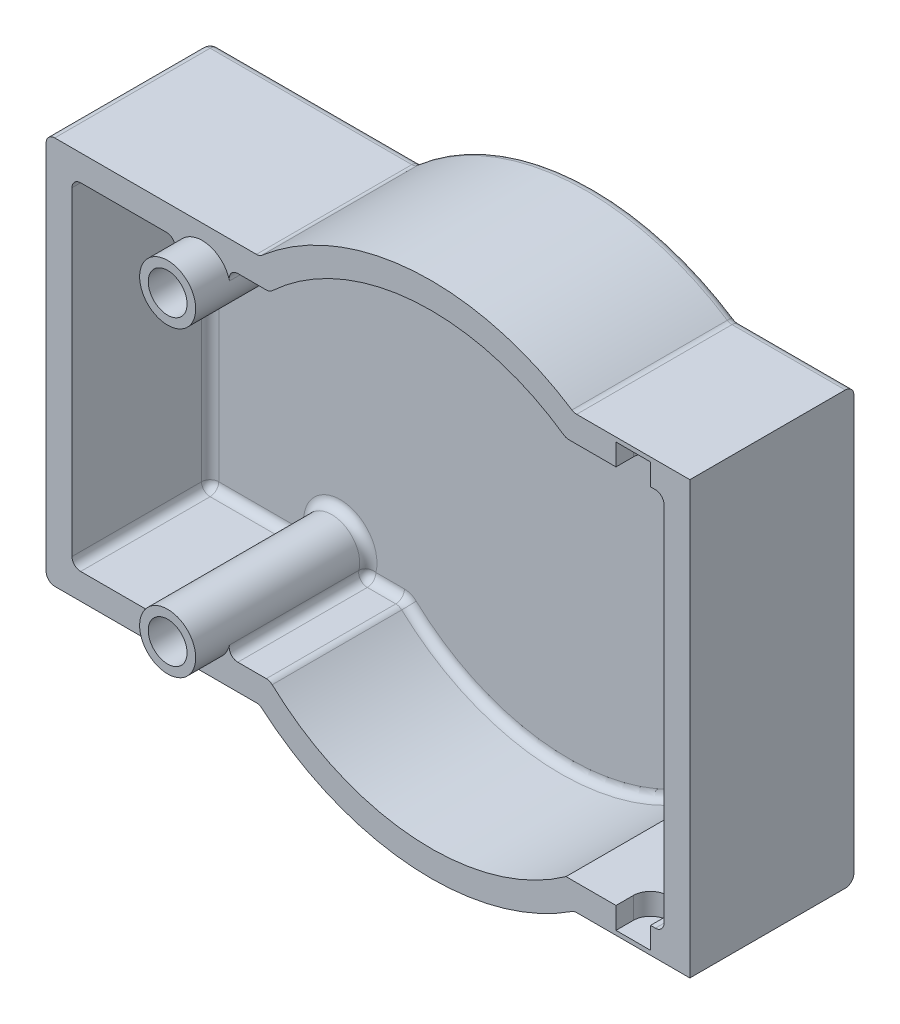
ISO-10303-21;
HEADER;
FILE_DESCRIPTION(('STEP AP214'),'2;1');
FILE_NAME('part.step','',(''),(''),'','','');
FILE_SCHEMA(('AUTOMOTIVE_DESIGN { 1 0 10303 214 1 1 1 1 }'));
ENDSEC;
DATA;
#1=APPLICATION_CONTEXT('core data for automotive mechanical design processes');
#2=APPLICATION_PROTOCOL_DEFINITION('international standard','automotive_design',2000,#1);
#3=PRODUCT_CONTEXT('',#1,'mechanical');
#4=PRODUCT('Part','Part','',(#3));
#5=PRODUCT_RELATED_PRODUCT_CATEGORY('part','',(#4));
#6=PRODUCT_DEFINITION_FORMATION('','',#4);
#7=PRODUCT_DEFINITION_CONTEXT('part definition',#1,'design');
#8=PRODUCT_DEFINITION('design','',#6,#7);
#9=PRODUCT_DEFINITION_SHAPE('','',#8);
#10=(LENGTH_UNIT() NAMED_UNIT(*) SI_UNIT(.MILLI.,.METRE.));
#11=(NAMED_UNIT(*) PLANE_ANGLE_UNIT() SI_UNIT($,.RADIAN.));
#12=(NAMED_UNIT(*) SI_UNIT($,.STERADIAN.) SOLID_ANGLE_UNIT());
#13=UNCERTAINTY_MEASURE_WITH_UNIT(LENGTH_MEASURE(1.E-05),#10,'distance_accuracy_value','');
#14=(GEOMETRIC_REPRESENTATION_CONTEXT(3) GLOBAL_UNCERTAINTY_ASSIGNED_CONTEXT((#13)) GLOBAL_UNIT_ASSIGNED_CONTEXT((#10,
#11,#12)) REPRESENTATION_CONTEXT('',''));
#15=CARTESIAN_POINT('',(0.,0.,0.));
#16=DIRECTION('',(0.,0.,1.));
#17=DIRECTION('',(1.,0.,0.));
#18=AXIS2_PLACEMENT_3D('',#15,#16,#17);
#19=CARTESIAN_POINT('',(-26.503123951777,-17.5,0.));
#20=DIRECTION('',(0.,0.,1.));
#21=DIRECTION('',(1.,0.,0.));
#22=AXIS2_PLACEMENT_3D('',#19,#20,#21);
#23=CYLINDRICAL_SURFACE('',#22,2.25);
#24=CARTESIAN_POINT('',(-26.503123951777,-17.5,23.));
#25=DIRECTION('',(0.,0.,1.));
#26=DIRECTION('',(1.,0.,0.));
#27=AXIS2_PLACEMENT_3D('',#24,#25,#26);
#28=CIRCLE('',#27,2.25);
#29=CARTESIAN_POINT('',(-24.253123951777,-17.5,23.));
#30=VERTEX_POINT('',#29);
#31=EDGE_CURVE('E1213',#30,#30,#28,.T.);
#32=ORIENTED_EDGE('',*,*,#31,.T.);
#33=EDGE_LOOP('',(#32));
#34=FACE_BOUND('',#33,.T.);
#35=CARTESIAN_POINT('',(-26.503123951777,-17.5,2.));
#36=DIRECTION('',(0.,0.,-1.));
#37=DIRECTION('',(-1.,0.,0.));
#38=AXIS2_PLACEMENT_3D('',#35,#36,#37);
#39=CIRCLE('',#38,2.25);
#40=CARTESIAN_POINT('',(-28.753123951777,-17.5,2.));
#41=VERTEX_POINT('',#40);
#42=EDGE_CURVE('E43',#41,#41,#39,.F.);
#43=ORIENTED_EDGE('',*,*,#42,.F.);
#44=EDGE_LOOP('',(#43));
#45=FACE_BOUND('',#44,.T.);
#46=ADVANCED_FACE('F39',(#34,#45),#23,.F.);
#47=CARTESIAN_POINT('',(-26.503123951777,17.5,0.));
#48=DIRECTION('',(0.,0.,1.));
#49=DIRECTION('',(1.,0.,0.));
#50=AXIS2_PLACEMENT_3D('',#47,#48,#49);
#51=CYLINDRICAL_SURFACE('',#50,2.25);
#52=CARTESIAN_POINT('',(-26.503123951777,17.5,23.));
#53=DIRECTION('',(0.,0.,1.));
#54=DIRECTION('',(1.,0.,0.));
#55=AXIS2_PLACEMENT_3D('',#52,#53,#54);
#56=CIRCLE('',#55,2.25);
#57=CARTESIAN_POINT('',(-24.253123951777,17.5,23.));
#58=VERTEX_POINT('',#57);
#59=EDGE_CURVE('E1209',#58,#58,#56,.T.);
#60=ORIENTED_EDGE('',*,*,#59,.T.);
#61=EDGE_LOOP('',(#60));
#62=FACE_BOUND('',#61,.T.);
#63=CARTESIAN_POINT('',(-26.503123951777,17.5,2.));
#64=DIRECTION('',(0.,0.,-1.));
#65=DIRECTION('',(-1.,0.,0.));
#66=AXIS2_PLACEMENT_3D('',#63,#64,#65);
#67=CIRCLE('',#66,2.25);
#68=CARTESIAN_POINT('',(-28.753123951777,17.5,2.));
#69=VERTEX_POINT('',#68);
#70=EDGE_CURVE('E1153',#69,#69,#67,.F.);
#71=ORIENTED_EDGE('',*,*,#70,.F.);
#72=EDGE_LOOP('',(#71));
#73=FACE_BOUND('',#72,.T.);
#74=ADVANCED_FACE('F940',(#62,#73),#51,.F.);
#75=CARTESIAN_POINT('',(-41.583123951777,-19.5,19.));
#76=DIRECTION('',(0.,1.,0.));
#77=DIRECTION('',(0.,0.,1.));
#78=AXIS2_PLACEMENT_3D('',#75,#76,#77);
#79=PLANE('',#78);
#80=DIRECTION('',(0.,0.,-1.));
#81=VECTOR('',#80,1.);
#82=CARTESIAN_POINT('',(-19.0722311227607,-19.5,19.));
#83=LINE('',#82,#81);
#84=CARTESIAN_POINT('',(-19.0722311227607,-19.5,19.));
#85=VERTEX_POINT('',#84);
#86=CARTESIAN_POINT('',(-19.0722311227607,-19.5,4.));
#87=VERTEX_POINT('',#86);
#88=EDGE_CURVE('E533',#85,#87,#83,.T.);
#89=ORIENTED_EDGE('',*,*,#88,.T.);
#90=DIRECTION('',(1.,0.,0.));
#91=VECTOR('',#90,1.);
#92=CARTESIAN_POINT('',(-22.3724460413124,-19.5,4.));
#93=LINE('',#92,#91);
#94=CARTESIAN_POINT('',(-22.3724460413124,-19.5,4.));
#95=VERTEX_POINT('',#94);
#96=EDGE_CURVE('E691',#87,#95,#93,.F.);
#97=ORIENTED_EDGE('',*,*,#96,.T.);
#98=DIRECTION('',(0.,0.,-1.));
#99=VECTOR('',#98,1.);
#100=CARTESIAN_POINT('',(-22.3724460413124,-19.5,19.));
#101=LINE('',#100,#99);
#102=CARTESIAN_POINT('',(-22.3724460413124,-19.5,19.));
#103=VERTEX_POINT('',#102);
#104=EDGE_CURVE('E531',#95,#103,#101,.F.);
#105=ORIENTED_EDGE('',*,*,#104,.T.);
#106=DIRECTION('',(1.,0.,0.));
#107=VECTOR('',#106,1.);
#108=CARTESIAN_POINT('',(-41.583123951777,-19.5,19.));
#109=LINE('',#108,#107);
#110=EDGE_CURVE('E1236',#103,#85,#109,.T.);
#111=ORIENTED_EDGE('',*,*,#110,.T.);
#112=EDGE_LOOP('',(#89,#97,#105,#111));
#113=FACE_BOUND('',#112,.T.);
#114=ADVANCED_FACE('F946',(#113),#79,.T.);
#115=DIRECTION('',(0.,0.,-1.));
#116=VECTOR('',#115,1.);
#117=CARTESIAN_POINT('',(-30.6338018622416,-19.5,19.));
#118=LINE('',#117,#116);
#119=CARTESIAN_POINT('',(-30.6338018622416,-19.5,19.));
#120=VERTEX_POINT('',#119);
#121=CARTESIAN_POINT('',(-30.6338018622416,-19.5,4.));
#122=VERTEX_POINT('',#121);
#123=EDGE_CURVE('E556',#120,#122,#118,.T.);
#124=ORIENTED_EDGE('',*,*,#123,.T.);
#125=DIRECTION('',(1.,0.,0.));
#126=VECTOR('',#125,1.);
#127=CARTESIAN_POINT('',(-40.583123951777,-19.5,4.));
#128=LINE('',#127,#126);
#129=CARTESIAN_POINT('',(-40.583123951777,-19.5,4.));
#130=VERTEX_POINT('',#129);
#131=EDGE_CURVE('E699',#122,#130,#128,.F.);
#132=ORIENTED_EDGE('',*,*,#131,.T.);
#133=DIRECTION('',(0.,0.,-1.));
#134=VECTOR('',#133,1.);
#135=CARTESIAN_POINT('',(-40.583123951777,-19.5,19.));
#136=LINE('',#135,#134);
#137=CARTESIAN_POINT('',(-40.583123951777,-19.5,19.));
#138=VERTEX_POINT('',#137);
#139=EDGE_CURVE('E554',#130,#138,#136,.F.);
#140=ORIENTED_EDGE('',*,*,#139,.T.);
#141=EDGE_CURVE('E1237',#138,#120,#109,.T.);
#142=ORIENTED_EDGE('',*,*,#141,.T.);
#143=EDGE_LOOP('',(#124,#132,#140,#142));
#144=FACE_BOUND('',#143,.T.);
#145=ADVANCED_FACE('F988',(#144),#79,.T.);
#146=CARTESIAN_POINT('',(-18.6748493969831,19.5,19.));
#147=DIRECTION('',(0.,-1.,0.));
#148=DIRECTION('',(0.,0.,-1.));
#149=AXIS2_PLACEMENT_3D('',#146,#147,#148);
#150=PLANE('',#149);
#151=DIRECTION('',(0.,0.,-1.));
#152=VECTOR('',#151,1.);
#153=CARTESIAN_POINT('',(-40.583123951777,19.5,3.));
#154=LINE('',#153,#152);
#155=CARTESIAN_POINT('',(-40.583123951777,19.5,19.));
#156=VERTEX_POINT('',#155);
#157=CARTESIAN_POINT('',(-40.583123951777,19.5,4.));
#158=VERTEX_POINT('',#157);
#159=EDGE_CURVE('E559',#156,#158,#154,.T.);
#160=ORIENTED_EDGE('',*,*,#159,.T.);
#161=DIRECTION('',(-1.,0.,0.));
#162=VECTOR('',#161,1.);
#163=CARTESIAN_POINT('',(-30.6338018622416,19.5,4.));
#164=LINE('',#163,#162);
#165=CARTESIAN_POINT('',(-30.6338018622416,19.5,4.));
#166=VERTEX_POINT('',#165);
#167=EDGE_CURVE('E707',#158,#166,#164,.F.);
#168=ORIENTED_EDGE('',*,*,#167,.T.);
#169=DIRECTION('',(0.,0.,-1.));
#170=VECTOR('',#169,1.);
#171=CARTESIAN_POINT('',(-30.6338018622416,19.5,19.));
#172=LINE('',#171,#170);
#173=CARTESIAN_POINT('',(-30.6338018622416,19.5,19.));
#174=VERTEX_POINT('',#173);
#175=EDGE_CURVE('E562',#166,#174,#172,.F.);
#176=ORIENTED_EDGE('',*,*,#175,.T.);
#177=DIRECTION('',(-1.,0.,0.));
#178=VECTOR('',#177,1.);
#179=CARTESIAN_POINT('',(-18.6748493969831,19.5,19.));
#180=LINE('',#179,#178);
#181=EDGE_CURVE('E1230',#174,#156,#180,.T.);
#182=ORIENTED_EDGE('',*,*,#181,.T.);
#183=EDGE_LOOP('',(#160,#168,#176,#182));
#184=FACE_BOUND('',#183,.T.);
#185=ADVANCED_FACE('F994',(#184),#150,.T.);
#186=DIRECTION('',(0.,0.,-1.));
#187=VECTOR('',#186,1.);
#188=CARTESIAN_POINT('',(-22.3724460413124,19.5,19.));
#189=LINE('',#188,#187);
#190=CARTESIAN_POINT('',(-22.3724460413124,19.5,19.));
#191=VERTEX_POINT('',#190);
#192=CARTESIAN_POINT('',(-22.3724460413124,19.5,4.));
#193=VERTEX_POINT('',#192);
#194=EDGE_CURVE('E571',#191,#193,#189,.T.);
#195=ORIENTED_EDGE('',*,*,#194,.T.);
#196=DIRECTION('',(-1.,0.,0.));
#197=VECTOR('',#196,1.);
#198=CARTESIAN_POINT('',(-19.0722311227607,19.5,4.));
#199=LINE('',#198,#197);
#200=CARTESIAN_POINT('',(-19.0722311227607,19.5,4.));
#201=VERTEX_POINT('',#200);
#202=EDGE_CURVE('E715',#193,#201,#199,.F.);
#203=ORIENTED_EDGE('',*,*,#202,.T.);
#204=DIRECTION('',(0.,0.,-1.));
#205=VECTOR('',#204,1.);
#206=CARTESIAN_POINT('',(-19.0722311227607,19.5,19.));
#207=LINE('',#206,#205);
#208=CARTESIAN_POINT('',(-19.0722311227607,19.5,19.));
#209=VERTEX_POINT('',#208);
#210=EDGE_CURVE('E569',#201,#209,#207,.F.);
#211=ORIENTED_EDGE('',*,*,#210,.T.);
#212=EDGE_CURVE('E1231',#209,#191,#180,.T.);
#213=ORIENTED_EDGE('',*,*,#212,.T.);
#214=EDGE_LOOP('',(#195,#203,#211,#213));
#215=FACE_BOUND('',#214,.T.);
#216=ADVANCED_FACE('F997',(#215),#150,.T.);
#217=CARTESIAN_POINT('',(30.,25.,3.));
#218=DIRECTION('',(0.,-1.,0.));
#219=DIRECTION('',(1.,0.,0.));
#220=AXIS2_PLACEMENT_3D('',#217,#218,#219);
#221=PLANE('',#220);
#222=DIRECTION('',(0.,0.,-1.));
#223=VECTOR('',#222,1.);
#224=CARTESIAN_POINT('',(30.,25.,3.));
#225=LINE('',#224,#223);
#226=CARTESIAN_POINT('',(30.,25.,19.));
#227=VERTEX_POINT('',#226);
#228=CARTESIAN_POINT('',(30.,25.,1.));
#229=VERTEX_POINT('',#228);
#230=EDGE_CURVE('E528',#227,#229,#225,.T.);
#231=ORIENTED_EDGE('',*,*,#230,.T.);
#232=DIRECTION('',(-1.,0.,0.));
#233=VECTOR('',#232,1.);
#234=CARTESIAN_POINT('',(30.,25.,1.));
#235=LINE('',#234,#233);
#236=CARTESIAN_POINT('',(16.8819430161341,25.,1.));
#237=VERTEX_POINT('',#236);
#238=EDGE_CURVE('E727',#229,#237,#235,.T.);
#239=ORIENTED_EDGE('',*,*,#238,.T.);
#240=DIRECTION('',(0.,0.,1.));
#241=VECTOR('',#240,1.);
#242=CARTESIAN_POINT('',(16.8819430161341,25.,19.));
#243=LINE('',#242,#241);
#244=CARTESIAN_POINT('',(16.8819430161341,25.,19.));
#245=VERTEX_POINT('',#244);
#246=EDGE_CURVE('E625',#237,#245,#243,.T.);
#247=ORIENTED_EDGE('',*,*,#246,.T.);
#248=DIRECTION('',(-1.,0.,0.));
#249=VECTOR('',#248,1.);
#250=CARTESIAN_POINT('',(30.,25.,19.));
#251=LINE('',#250,#249);
#252=EDGE_CURVE('E502',#227,#245,#251,.T.);
#253=ORIENTED_EDGE('',*,*,#252,.F.);
#254=EDGE_LOOP('',(#231,#239,#247,#253));
#255=FACE_BOUND('',#254,.T.);
#256=ADVANCED_FACE('F1038',(#255),#221,.F.);
#257=CARTESIAN_POINT('',(0.,0.,3.));
#258=DIRECTION('',(0.,0.,-1.));
#259=DIRECTION('',(-1.,0.,0.));
#260=AXIS2_PLACEMENT_3D('',#257,#258,#259);
#261=CYLINDRICAL_SURFACE('',#260,30.);
#262=DIRECTION('',(0.,0.,-1.));
#263=VECTOR('',#262,1.);
#264=CARTESIAN_POINT('',(16.3373642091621,25.1612903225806,3.));
#265=LINE('',#264,#263);
#266=CARTESIAN_POINT('',(16.3373642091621,25.1612903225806,19.));
#267=VERTEX_POINT('',#266);
#268=CARTESIAN_POINT('',(16.3373642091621,25.1612903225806,1.));
#269=VERTEX_POINT('',#268);
#270=EDGE_CURVE('E622',#267,#269,#265,.T.);
#271=ORIENTED_EDGE('',*,*,#270,.T.);
#272=CARTESIAN_POINT('',(0.,0.,1.));
#273=DIRECTION('',(0.,0.,1.));
#274=DIRECTION('',(1.,0.,0.));
#275=AXIS2_PLACEMENT_3D('',#272,#273,#274);
#276=CIRCLE('',#275,30.);
#277=CARTESIAN_POINT('',(-19.5653870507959,22.741935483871,1.));
#278=VERTEX_POINT('',#277);
#279=EDGE_CURVE('E12',#269,#278,#276,.T.);
#280=ORIENTED_EDGE('',*,*,#279,.T.);
#281=DIRECTION('',(0.,0.,-1.));
#282=VECTOR('',#281,1.);
#283=CARTESIAN_POINT('',(-19.5653870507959,22.741935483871,3.));
#284=LINE('',#283,#282);
#285=CARTESIAN_POINT('',(-19.5653870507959,22.741935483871,19.));
#286=VERTEX_POINT('',#285);
#287=EDGE_CURVE('E620',#278,#286,#284,.F.);
#288=ORIENTED_EDGE('',*,*,#287,.T.);
#289=CARTESIAN_POINT('',(0.,0.,19.));
#290=DIRECTION('',(0.,0.,1.));
#291=DIRECTION('',(1.,0.,0.));
#292=AXIS2_PLACEMENT_3D('',#289,#290,#291);
#293=CIRCLE('',#292,30.);
#294=EDGE_CURVE('E505',#267,#286,#293,.T.);
#295=ORIENTED_EDGE('',*,*,#294,.F.);
#296=EDGE_LOOP('',(#271,#280,#288,#295));
#297=FACE_BOUND('',#296,.T.);
#298=ADVANCED_FACE('F1034',(#297),#261,.T.);
#299=CARTESIAN_POINT('',(-19.8431348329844,22.5,3.));
#300=DIRECTION('',(0.,-1.,0.));
#301=DIRECTION('',(0.,0.,-1.));
#302=AXIS2_PLACEMENT_3D('',#299,#300,#301);
#303=PLANE('',#302);
#304=DIRECTION('',(0.,0.,1.));
#305=VECTOR('',#304,1.);
#306=CARTESIAN_POINT('',(-20.2175666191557,22.5,0.));
#307=LINE('',#306,#305);
#308=CARTESIAN_POINT('',(-20.2175666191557,22.5,19.));
#309=VERTEX_POINT('',#308);
#310=CARTESIAN_POINT('',(-20.2175666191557,22.5,1.));
#311=VERTEX_POINT('',#310);
#312=EDGE_CURVE('E607',#309,#311,#307,.F.);
#313=ORIENTED_EDGE('',*,*,#312,.T.);
#314=DIRECTION('',(-1.,0.,0.));
#315=VECTOR('',#314,1.);
#316=CARTESIAN_POINT('',(-19.8431348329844,22.5,1.));
#317=LINE('',#316,#315);
#318=CARTESIAN_POINT('',(-43.583123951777,22.5,1.));
#319=VERTEX_POINT('',#318);
#320=EDGE_CURVE('E774',#311,#319,#317,.T.);
#321=ORIENTED_EDGE('',*,*,#320,.T.);
#322=DIRECTION('',(0.,0.,-1.));
#323=VECTOR('',#322,1.);
#324=CARTESIAN_POINT('',(-43.583123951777,22.5,3.));
#325=LINE('',#324,#323);
#326=CARTESIAN_POINT('',(-43.583123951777,22.5,19.));
#327=VERTEX_POINT('',#326);
#328=EDGE_CURVE('E610',#319,#327,#325,.F.);
#329=ORIENTED_EDGE('',*,*,#328,.T.);
#330=DIRECTION('',(-1.,0.,0.));
#331=VECTOR('',#330,1.);
#332=CARTESIAN_POINT('',(-19.8431348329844,22.5,19.));
#333=LINE('',#332,#331);
#334=EDGE_CURVE('E508',#309,#327,#333,.T.);
#335=ORIENTED_EDGE('',*,*,#334,.F.);
#336=EDGE_LOOP('',(#313,#321,#329,#335));
#337=FACE_BOUND('',#336,.T.);
#338=ADVANCED_FACE('F1030',(#337),#303,.F.);
#339=CARTESIAN_POINT('',(-44.583123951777,22.5,3.));
#340=DIRECTION('',(1.,0.,0.));
#341=DIRECTION('',(0.,0.,-1.));
#342=AXIS2_PLACEMENT_3D('',#339,#340,#341);
#343=PLANE('',#342);
#344=DIRECTION('',(0.,0.,-1.));
#345=VECTOR('',#344,1.);
#346=CARTESIAN_POINT('',(-44.583123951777,21.5,3.));
#347=LINE('',#346,#345);
#348=CARTESIAN_POINT('',(-44.583123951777,21.5,19.));
#349=VERTEX_POINT('',#348);
#350=CARTESIAN_POINT('',(-44.583123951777,21.5,1.));
#351=VERTEX_POINT('',#350);
#352=EDGE_CURVE('E602',#349,#351,#347,.T.);
#353=ORIENTED_EDGE('',*,*,#352,.T.);
#354=DIRECTION('',(0.,-1.,0.));
#355=VECTOR('',#354,1.);
#356=CARTESIAN_POINT('',(-44.583123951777,22.5,1.));
#357=LINE('',#356,#355);
#358=CARTESIAN_POINT('',(-44.583123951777,-21.5,1.));
#359=VERTEX_POINT('',#358);
#360=EDGE_CURVE('E770',#351,#359,#357,.T.);
#361=ORIENTED_EDGE('',*,*,#360,.T.);
#362=DIRECTION('',(0.,0.,-1.));
#363=VECTOR('',#362,1.);
#364=CARTESIAN_POINT('',(-44.583123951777,-21.5,3.));
#365=LINE('',#364,#363);
#366=CARTESIAN_POINT('',(-44.583123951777,-21.5,19.));
#367=VERTEX_POINT('',#366);
#368=EDGE_CURVE('E605',#359,#367,#365,.F.);
#369=ORIENTED_EDGE('',*,*,#368,.T.);
#370=DIRECTION('',(0.,-1.,0.));
#371=VECTOR('',#370,1.);
#372=CARTESIAN_POINT('',(-44.583123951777,22.5,19.));
#373=LINE('',#372,#371);
#374=EDGE_CURVE('E511',#349,#367,#373,.T.);
#375=ORIENTED_EDGE('',*,*,#374,.F.);
#376=EDGE_LOOP('',(#353,#361,#369,#375));
#377=FACE_BOUND('',#376,.T.);
#378=ADVANCED_FACE('F1026',(#377),#343,.F.);
#379=CARTESIAN_POINT('',(-44.583123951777,-22.5,3.));
#380=DIRECTION('',(0.,1.,0.));
#381=DIRECTION('',(0.,0.,1.));
#382=AXIS2_PLACEMENT_3D('',#379,#380,#381);
#383=PLANE('',#382);
#384=DIRECTION('',(0.,0.,-1.));
#385=VECTOR('',#384,1.);
#386=CARTESIAN_POINT('',(-43.583123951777,-22.5,3.));
#387=LINE('',#386,#385);
#388=CARTESIAN_POINT('',(-43.583123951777,-22.5,19.));
#389=VERTEX_POINT('',#388);
#390=CARTESIAN_POINT('',(-43.583123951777,-22.5,1.));
#391=VERTEX_POINT('',#390);
#392=EDGE_CURVE('E599',#389,#391,#387,.T.);
#393=ORIENTED_EDGE('',*,*,#392,.T.);
#394=DIRECTION('',(1.,0.,0.));
#395=VECTOR('',#394,1.);
#396=CARTESIAN_POINT('',(-44.583123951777,-22.5,1.));
#397=LINE('',#396,#395);
#398=CARTESIAN_POINT('',(-20.2175666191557,-22.5,1.));
#399=VERTEX_POINT('',#398);
#400=EDGE_CURVE('E766',#391,#399,#397,.T.);
#401=ORIENTED_EDGE('',*,*,#400,.T.);
#402=DIRECTION('',(0.,0.,1.));
#403=VECTOR('',#402,1.);
#404=CARTESIAN_POINT('',(-20.2175666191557,-22.5,19.));
#405=LINE('',#404,#403);
#406=CARTESIAN_POINT('',(-20.2175666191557,-22.5,19.));
#407=VERTEX_POINT('',#406);
#408=EDGE_CURVE('E597',#399,#407,#405,.T.);
#409=ORIENTED_EDGE('',*,*,#408,.T.);
#410=DIRECTION('',(1.,0.,0.));
#411=VECTOR('',#410,1.);
#412=CARTESIAN_POINT('',(-44.583123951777,-22.5,19.));
#413=LINE('',#412,#411);
#414=EDGE_CURVE('E514',#389,#407,#413,.T.);
#415=ORIENTED_EDGE('',*,*,#414,.F.);
#416=EDGE_LOOP('',(#393,#401,#409,#415));
#417=FACE_BOUND('',#416,.T.);
#418=ADVANCED_FACE('F1022',(#417),#383,.F.);
#419=CARTESIAN_POINT('',(0.,0.,3.));
#420=DIRECTION('',(0.,0.,-1.));
#421=DIRECTION('',(-1.,0.,0.));
#422=AXIS2_PLACEMENT_3D('',#419,#420,#421);
#423=CYLINDRICAL_SURFACE('',#422,30.);
#424=DIRECTION('',(0.,0.,-1.));
#425=VECTOR('',#424,1.);
#426=CARTESIAN_POINT('',(-19.5653870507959,-22.741935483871,3.));
#427=LINE('',#426,#425);
#428=CARTESIAN_POINT('',(-19.5653870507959,-22.741935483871,19.));
#429=VERTEX_POINT('',#428);
#430=CARTESIAN_POINT('',(-19.5653870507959,-22.741935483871,1.));
#431=VERTEX_POINT('',#430);
#432=EDGE_CURVE('E615',#429,#431,#427,.T.);
#433=ORIENTED_EDGE('',*,*,#432,.T.);
#434=CARTESIAN_POINT('',(0.,0.,1.));
#435=DIRECTION('',(0.,0.,1.));
#436=DIRECTION('',(1.,0.,0.));
#437=AXIS2_PLACEMENT_3D('',#434,#435,#436);
#438=CIRCLE('',#437,30.);
#439=CARTESIAN_POINT('',(16.3373642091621,-25.1612903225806,1.));
#440=VERTEX_POINT('',#439);
#441=EDGE_CURVE('E762',#431,#440,#438,.T.);
#442=ORIENTED_EDGE('',*,*,#441,.T.);
#443=DIRECTION('',(0.,0.,-1.));
#444=VECTOR('',#443,1.);
#445=CARTESIAN_POINT('',(16.3373642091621,-25.1612903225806,3.));
#446=LINE('',#445,#444);
#447=CARTESIAN_POINT('',(16.3373642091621,-25.1612903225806,19.));
#448=VERTEX_POINT('',#447);
#449=EDGE_CURVE('E618',#440,#448,#446,.F.);
#450=ORIENTED_EDGE('',*,*,#449,.T.);
#451=CARTESIAN_POINT('',(0.,0.,19.));
#452=DIRECTION('',(0.,0.,1.));
#453=DIRECTION('',(1.,0.,0.));
#454=AXIS2_PLACEMENT_3D('',#451,#452,#453);
#455=CIRCLE('',#454,30.);
#456=EDGE_CURVE('E517',#429,#448,#455,.T.);
#457=ORIENTED_EDGE('',*,*,#456,.F.);
#458=EDGE_LOOP('',(#433,#442,#450,#457));
#459=FACE_BOUND('',#458,.T.);
#460=ADVANCED_FACE('F1018',(#459),#423,.T.);
#461=CARTESIAN_POINT('',(30.,-25.,3.));
#462=DIRECTION('',(0.,1.,0.));
#463=DIRECTION('',(-1.,0.,0.));
#464=AXIS2_PLACEMENT_3D('',#461,#462,#463);
#465=PLANE('',#464);
#466=DIRECTION('',(0.,0.,1.));
#467=VECTOR('',#466,1.);
#468=CARTESIAN_POINT('',(16.8819430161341,-25.,0.));
#469=LINE('',#468,#467);
#470=CARTESIAN_POINT('',(16.8819430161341,-25.,19.));
#471=VERTEX_POINT('',#470);
#472=CARTESIAN_POINT('',(16.8819430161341,-25.,1.));
#473=VERTEX_POINT('',#472);
#474=EDGE_CURVE('E612',#471,#473,#469,.F.);
#475=ORIENTED_EDGE('',*,*,#474,.T.);
#476=DIRECTION('',(1.,0.,0.));
#477=VECTOR('',#476,1.);
#478=CARTESIAN_POINT('',(30.,-25.,1.));
#479=LINE('',#478,#477);
#480=CARTESIAN_POINT('',(30.,-25.,1.));
#481=VERTEX_POINT('',#480);
#482=EDGE_CURVE('E758',#473,#481,#479,.T.);
#483=ORIENTED_EDGE('',*,*,#482,.T.);
#484=DIRECTION('',(0.,0.,-1.));
#485=VECTOR('',#484,1.);
#486=CARTESIAN_POINT('',(30.,-25.,3.));
#487=LINE('',#486,#485);
#488=CARTESIAN_POINT('',(30.,-25.,19.));
#489=VERTEX_POINT('',#488);
#490=EDGE_CURVE('E525',#489,#481,#487,.T.);
#491=ORIENTED_EDGE('',*,*,#490,.F.);
#492=DIRECTION('',(1.,0.,0.));
#493=VECTOR('',#492,1.);
#494=CARTESIAN_POINT('',(16.583123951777,-25.,19.));
#495=LINE('',#494,#493);
#496=EDGE_CURVE('E520',#471,#489,#495,.T.);
#497=ORIENTED_EDGE('',*,*,#496,.F.);
#498=EDGE_LOOP('',(#475,#483,#491,#497));
#499=FACE_BOUND('',#498,.T.);
#500=ADVANCED_FACE('F1014',(#499),#465,.F.);
#501=CARTESIAN_POINT('',(30.,0.,3.));
#502=DIRECTION('',(-1.,0.,0.));
#503=DIRECTION('',(0.,-1.,0.));
#504=AXIS2_PLACEMENT_3D('',#501,#502,#503);
#505=PLANE('',#504);
#506=DIRECTION('',(0.,1.,0.));
#507=VECTOR('',#506,1.);
#508=CARTESIAN_POINT('',(30.,0.,0.));
#509=LINE('',#508,#507);
#510=CARTESIAN_POINT('',(30.,-24.,0.));
#511=VERTEX_POINT('',#510);
#512=CARTESIAN_POINT('',(30.,24.,0.));
#513=VERTEX_POINT('',#512);
#514=EDGE_CURVE('E522',#511,#513,#509,.T.);
#515=ORIENTED_EDGE('',*,*,#514,.T.);
#516=CARTESIAN_POINT('',(30.,24.,1.));
#517=DIRECTION('',(-1.,0.,0.));
#518=DIRECTION('',(0.,-1.,0.));
#519=AXIS2_PLACEMENT_3D('',#516,#517,#518);
#520=CIRCLE('',#519,1.);
#521=EDGE_CURVE('E754',#513,#229,#520,.F.);
#522=ORIENTED_EDGE('',*,*,#521,.T.);
#523=ORIENTED_EDGE('',*,*,#230,.F.);
#524=DIRECTION('',(0.,1.,0.));
#525=VECTOR('',#524,1.);
#526=CARTESIAN_POINT('',(30.,-25.,19.));
#527=LINE('',#526,#525);
#528=EDGE_CURVE('E499',#489,#227,#527,.T.);
#529=ORIENTED_EDGE('',*,*,#528,.F.);
#530=ORIENTED_EDGE('',*,*,#490,.T.);
#531=CARTESIAN_POINT('',(30.,-24.,1.));
#532=DIRECTION('',(-1.,0.,0.));
#533=DIRECTION('',(0.,-1.,0.));
#534=AXIS2_PLACEMENT_3D('',#531,#532,#533);
#535=CIRCLE('',#534,1.);
#536=EDGE_CURVE('E752',#481,#511,#535,.F.);
#537=ORIENTED_EDGE('',*,*,#536,.T.);
#538=EDGE_LOOP('',(#515,#522,#523,#529,#530,#537));
#539=FACE_BOUND('',#538,.T.);
#540=ADVANCED_FACE('F1010',(#539),#505,.F.);
#541=CARTESIAN_POINT('',(0.,0.,0.));
#542=DIRECTION('',(0.,0.,1.));
#543=DIRECTION('',(1.,0.,0.));
#544=AXIS2_PLACEMENT_3D('',#541,#542,#543);
#545=PLANE('',#544);
#546=DIRECTION('',(1.,0.,0.));
#547=VECTOR('',#546,1.);
#548=CARTESIAN_POINT('',(-23.003123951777,21.,0.));
#549=LINE('',#548,#547);
#550=CARTESIAN_POINT('',(-30.003123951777,21.,0.));
#551=VERTEX_POINT('',#550);
#552=CARTESIAN_POINT('',(-23.003123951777,21.,0.));
#553=VERTEX_POINT('',#552);
#554=EDGE_CURVE('E1449',#551,#553,#549,.T.);
#555=ORIENTED_EDGE('',*,*,#554,.F.);
#556=DIRECTION('',(0.,1.,0.));
#557=VECTOR('',#556,1.);
#558=CARTESIAN_POINT('',(-30.003123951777,21.,0.));
#559=LINE('',#558,#557);
#560=CARTESIAN_POINT('',(-30.003123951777,14.,0.));
#561=VERTEX_POINT('',#560);
#562=EDGE_CURVE('E1202',#561,#551,#559,.T.);
#563=ORIENTED_EDGE('',*,*,#562,.F.);
#564=DIRECTION('',(-1.,0.,0.));
#565=VECTOR('',#564,1.);
#566=CARTESIAN_POINT('',(-23.003123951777,14.,0.));
#567=LINE('',#566,#565);
#568=CARTESIAN_POINT('',(-23.003123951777,14.,0.));
#569=VERTEX_POINT('',#568);
#570=EDGE_CURVE('E1167',#569,#561,#567,.T.);
#571=ORIENTED_EDGE('',*,*,#570,.F.);
#572=DIRECTION('',(0.,-1.,0.));
#573=VECTOR('',#572,1.);
#574=CARTESIAN_POINT('',(-23.003123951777,21.,0.));
#575=LINE('',#574,#573);
#576=EDGE_CURVE('E1451',#553,#569,#575,.T.);
#577=ORIENTED_EDGE('',*,*,#576,.F.);
#578=EDGE_LOOP('',(#555,#563,#571,#577));
#579=FACE_BOUND('',#578,.T.);
#580=DIRECTION('',(1.,0.,0.));
#581=VECTOR('',#580,1.);
#582=CARTESIAN_POINT('',(-23.003123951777,-14.,0.));
#583=LINE('',#582,#581);
#584=CARTESIAN_POINT('',(-30.003123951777,-14.,0.));
#585=VERTEX_POINT('',#584);
#586=CARTESIAN_POINT('',(-23.003123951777,-14.,0.));
#587=VERTEX_POINT('',#586);
#588=EDGE_CURVE('E1191',#585,#587,#583,.T.);
#589=ORIENTED_EDGE('',*,*,#588,.F.);
#590=DIRECTION('',(0.,1.,0.));
#591=VECTOR('',#590,1.);
#592=CARTESIAN_POINT('',(-30.003123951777,-14.,0.));
#593=LINE('',#592,#591);
#594=CARTESIAN_POINT('',(-30.003123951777,-21.,0.));
#595=VERTEX_POINT('',#594);
#596=EDGE_CURVE('E1189',#595,#585,#593,.T.);
#597=ORIENTED_EDGE('',*,*,#596,.F.);
#598=DIRECTION('',(-1.,0.,0.));
#599=VECTOR('',#598,1.);
#600=CARTESIAN_POINT('',(-23.003123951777,-21.,0.));
#601=LINE('',#600,#599);
#602=CARTESIAN_POINT('',(-23.003123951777,-21.,0.));
#603=VERTEX_POINT('',#602);
#604=EDGE_CURVE('E1179',#603,#595,#601,.T.);
#605=ORIENTED_EDGE('',*,*,#604,.F.);
#606=DIRECTION('',(0.,-1.,0.));
#607=VECTOR('',#606,1.);
#608=CARTESIAN_POINT('',(-23.003123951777,-14.,0.));
#609=LINE('',#608,#607);
#610=EDGE_CURVE('E1195',#587,#603,#609,.T.);
#611=ORIENTED_EDGE('',*,*,#610,.F.);
#612=EDGE_LOOP('',(#589,#597,#605,#611));
#613=FACE_BOUND('',#612,.T.);
#614=CARTESIAN_POINT('',(16.8819430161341,26.,0.));
#615=DIRECTION('',(0.,0.,1.));
#616=DIRECTION('',(1.,0.,0.));
#617=AXIS2_PLACEMENT_3D('',#614,#615,#616);
#618=CIRCLE('',#617,2.);
#619=CARTESIAN_POINT('',(15.79278540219,24.3225806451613,0.));
#620=VERTEX_POINT('',#619);
#621=CARTESIAN_POINT('',(16.8819430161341,24.,0.));
#622=VERTEX_POINT('',#621);
#623=EDGE_CURVE('E748',#620,#622,#618,.T.);
#624=ORIENTED_EDGE('',*,*,#623,.T.);
#625=DIRECTION('',(-1.,0.,0.));
#626=VECTOR('',#625,1.);
#627=CARTESIAN_POINT('',(0.,24.,0.));
#628=LINE('',#627,#626);
#629=EDGE_CURVE('E750',#622,#513,#628,.F.);
#630=ORIENTED_EDGE('',*,*,#629,.T.);
#631=ORIENTED_EDGE('',*,*,#514,.F.);
#632=DIRECTION('',(1.,0.,0.));
#633=VECTOR('',#632,1.);
#634=CARTESIAN_POINT('',(0.,-24.,0.));
#635=LINE('',#634,#633);
#636=CARTESIAN_POINT('',(16.8819430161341,-24.,0.));
#637=VERTEX_POINT('',#636);
#638=EDGE_CURVE('E746',#511,#637,#635,.F.);
#639=ORIENTED_EDGE('',*,*,#638,.T.);
#640=CARTESIAN_POINT('',(16.8819430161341,-26.,0.));
#641=DIRECTION('',(0.,0.,1.));
#642=DIRECTION('',(1.,0.,0.));
#643=AXIS2_PLACEMENT_3D('',#640,#641,#642);
#644=CIRCLE('',#643,2.);
#645=CARTESIAN_POINT('',(15.79278540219,-24.3225806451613,0.));
#646=VERTEX_POINT('',#645);
#647=EDGE_CURVE('E744',#637,#646,#644,.T.);
#648=ORIENTED_EDGE('',*,*,#647,.T.);
#649=CARTESIAN_POINT('',(0.,0.,0.));
#650=DIRECTION('',(0.,0.,1.));
#651=DIRECTION('',(1.,0.,0.));
#652=AXIS2_PLACEMENT_3D('',#649,#650,#651);
#653=CIRCLE('',#652,29.);
#654=CARTESIAN_POINT('',(-18.913207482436,-21.9838709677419,0.));
#655=VERTEX_POINT('',#654);
#656=EDGE_CURVE('E742',#646,#655,#653,.F.);
#657=ORIENTED_EDGE('',*,*,#656,.T.);
#658=CARTESIAN_POINT('',(-20.2175666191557,-23.5,0.));
#659=DIRECTION('',(0.,0.,1.));
#660=DIRECTION('',(1.,0.,0.));
#661=AXIS2_PLACEMENT_3D('',#658,#659,#660);
#662=CIRCLE('',#661,2.);
#663=CARTESIAN_POINT('',(-20.2175666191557,-21.5,0.));
#664=VERTEX_POINT('',#663);
#665=EDGE_CURVE('E740',#655,#664,#662,.T.);
#666=ORIENTED_EDGE('',*,*,#665,.T.);
#667=DIRECTION('',(1.,0.,0.));
#668=VECTOR('',#667,1.);
#669=CARTESIAN_POINT('',(0.,-21.5,0.));
#670=LINE('',#669,#668);
#671=CARTESIAN_POINT('',(-43.583123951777,-21.5,0.));
#672=VERTEX_POINT('',#671);
#673=EDGE_CURVE('E738',#664,#672,#670,.F.);
#674=ORIENTED_EDGE('',*,*,#673,.T.);
#675=DIRECTION('',(0.,-1.,0.));
#676=VECTOR('',#675,1.);
#677=CARTESIAN_POINT('',(-43.583123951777,0.,0.));
#678=LINE('',#677,#676);
#679=CARTESIAN_POINT('',(-43.583123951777,21.5,0.));
#680=VERTEX_POINT('',#679);
#681=EDGE_CURVE('E736',#672,#680,#678,.F.);
#682=ORIENTED_EDGE('',*,*,#681,.T.);
#683=DIRECTION('',(-1.,0.,0.));
#684=VECTOR('',#683,1.);
#685=CARTESIAN_POINT('',(0.,21.5,0.));
#686=LINE('',#685,#684);
#687=CARTESIAN_POINT('',(-20.2175666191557,21.5,0.));
#688=VERTEX_POINT('',#687);
#689=EDGE_CURVE('E734',#680,#688,#686,.F.);
#690=ORIENTED_EDGE('',*,*,#689,.T.);
#691=CARTESIAN_POINT('',(-20.2175666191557,23.5,0.));
#692=DIRECTION('',(0.,0.,1.));
#693=DIRECTION('',(1.,0.,0.));
#694=AXIS2_PLACEMENT_3D('',#691,#692,#693);
#695=CIRCLE('',#694,2.);
#696=CARTESIAN_POINT('',(-18.913207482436,21.9838709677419,0.));
#697=VERTEX_POINT('',#696);
#698=EDGE_CURVE('E732',#688,#697,#695,.T.);
#699=ORIENTED_EDGE('',*,*,#698,.T.);
#700=CARTESIAN_POINT('',(0.,0.,0.));
#701=DIRECTION('',(0.,0.,1.));
#702=DIRECTION('',(1.,0.,0.));
#703=AXIS2_PLACEMENT_3D('',#700,#701,#702);
#704=CIRCLE('',#703,29.);
#705=EDGE_CURVE('E730',#697,#620,#704,.F.);
#706=ORIENTED_EDGE('',*,*,#705,.T.);
#707=EDGE_LOOP('',(#624,#630,#631,#639,#648,#657,#666,#674,#682,#690,#699,#706));
#708=FACE_BOUND('',#707,.T.);
#709=ADVANCED_FACE('F1004',(#579,#613,#708),#545,.F.);
#710=CARTESIAN_POINT('',(0.,0.,19.));
#711=DIRECTION('',(0.,0.,1.));
#712=DIRECTION('',(1.,0.,0.));
#713=AXIS2_PLACEMENT_3D('',#710,#711,#712);
#714=PLANE('',#713);
#715=DIRECTION('',(0.,1.,0.));
#716=VECTOR('',#715,1.);
#717=CARTESIAN_POINT('',(25.4409715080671,-30.6568542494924,19.));
#718=LINE('',#717,#716);
#719=CARTESIAN_POINT('',(25.4409715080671,-24.5,19.));
#720=VERTEX_POINT('',#719);
#721=CARTESIAN_POINT('',(25.4409715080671,-22.,19.));
#722=VERTEX_POINT('',#721);
#723=EDGE_CURVE('E477',#720,#722,#718,.T.);
#724=ORIENTED_EDGE('',*,*,#723,.F.);
#725=DIRECTION('',(-1.,0.,0.));
#726=VECTOR('',#725,1.);
#727=CARTESIAN_POINT('',(15.6524758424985,-24.5,19.));
#728=LINE('',#727,#726);
#729=CARTESIAN_POINT('',(21.4409715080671,-24.5,19.));
#730=VERTEX_POINT('',#729);
#731=EDGE_CURVE('E476',#720,#730,#728,.T.);
#732=ORIENTED_EDGE('',*,*,#731,.T.);
#733=DIRECTION('',(0.,1.,0.));
#734=VECTOR('',#733,1.);
#735=CARTESIAN_POINT('',(21.4409715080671,-30.6568542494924,19.));
#736=LINE('',#735,#734);
#737=CARTESIAN_POINT('',(21.4409715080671,-22.,19.));
#738=VERTEX_POINT('',#737);
#739=EDGE_CURVE('E460',#730,#738,#736,.T.);
#740=ORIENTED_EDGE('',*,*,#739,.T.);
#741=DIRECTION('',(1.,0.,0.));
#742=VECTOR('',#741,1.);
#743=CARTESIAN_POINT('',(15.6524758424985,-22.,19.));
#744=LINE('',#743,#742);
#745=CARTESIAN_POINT('',(15.6524758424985,-22.,19.));
#746=VERTEX_POINT('',#745);
#747=EDGE_CURVE('E474',#746,#738,#744,.T.);
#748=ORIENTED_EDGE('',*,*,#747,.F.);
#749=CARTESIAN_POINT('',(0.,0.,19.));
#750=DIRECTION('',(0.,0.,1.));
#751=DIRECTION('',(1.,0.,0.));
#752=AXIS2_PLACEMENT_3D('',#749,#750,#751);
#753=CIRCLE('',#752,27.);
#754=CARTESIAN_POINT('',(-18.3910800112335,-19.7678571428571,19.));
#755=VERTEX_POINT('',#754);
#756=EDGE_CURVE('E491',#755,#746,#753,.T.);
#757=ORIENTED_EDGE('',*,*,#756,.F.);
#758=CARTESIAN_POINT('',(-19.0722311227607,-20.5,19.));
#759=DIRECTION('',(0.,0.,1.));
#760=DIRECTION('',(1.,0.,0.));
#761=AXIS2_PLACEMENT_3D('',#758,#759,#760);
#762=CIRCLE('',#761,1.);
#763=EDGE_CURVE('E547',#755,#85,#762,.T.);
#764=ORIENTED_EDGE('',*,*,#763,.T.);
#765=ORIENTED_EDGE('',*,*,#110,.F.);
#766=CARTESIAN_POINT('',(-22.3724460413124,-18.5,19.));
#767=DIRECTION('',(0.,0.,1.));
#768=DIRECTION('',(1.,0.,0.));
#769=AXIS2_PLACEMENT_3D('',#766,#767,#768);
#770=CIRCLE('',#769,1.);
#771=CARTESIAN_POINT('',(-23.3443702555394,-18.2647058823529,19.));
#772=VERTEX_POINT('',#771);
#773=EDGE_CURVE('E627',#103,#772,#770,.F.);
#774=ORIENTED_EDGE('',*,*,#773,.T.);
#775=CARTESIAN_POINT('',(-26.503123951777,-17.5,19.));
#776=DIRECTION('',(0.,0.,1.));
#777=DIRECTION('',(1.,0.,0.));
#778=AXIS2_PLACEMENT_3D('',#775,#776,#777);
#779=CIRCLE('',#778,3.25);
#780=CARTESIAN_POINT('',(-29.6618776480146,-18.2647058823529,19.));
#781=VERTEX_POINT('',#780);
#782=EDGE_CURVE('E1218',#772,#781,#779,.F.);
#783=ORIENTED_EDGE('',*,*,#782,.T.);
#784=CARTESIAN_POINT('',(-30.6338018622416,-18.5,19.));
#785=DIRECTION('',(0.,0.,1.));
#786=DIRECTION('',(1.,0.,0.));
#787=AXIS2_PLACEMENT_3D('',#784,#785,#786);
#788=CIRCLE('',#787,1.);
#789=EDGE_CURVE('E630',#781,#120,#788,.F.);
#790=ORIENTED_EDGE('',*,*,#789,.T.);
#791=ORIENTED_EDGE('',*,*,#141,.F.);
#792=CARTESIAN_POINT('',(-40.583123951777,-18.5,19.));
#793=DIRECTION('',(0.,0.,1.));
#794=DIRECTION('',(1.,0.,0.));
#795=AXIS2_PLACEMENT_3D('',#792,#793,#794);
#796=CIRCLE('',#795,1.);
#797=CARTESIAN_POINT('',(-41.583123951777,-18.5,19.));
#798=VERTEX_POINT('',#797);
#799=EDGE_CURVE('E637',#138,#798,#796,.F.);
#800=ORIENTED_EDGE('',*,*,#799,.T.);
#801=DIRECTION('',(0.,-1.,0.));
#802=VECTOR('',#801,1.);
#803=CARTESIAN_POINT('',(-41.583123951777,19.5,19.));
#804=LINE('',#803,#802);
#805=CARTESIAN_POINT('',(-41.583123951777,18.5,19.));
#806=VERTEX_POINT('',#805);
#807=EDGE_CURVE('E1234',#806,#798,#804,.T.);
#808=ORIENTED_EDGE('',*,*,#807,.F.);
#809=CARTESIAN_POINT('',(-40.583123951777,18.5,19.));
#810=DIRECTION('',(0.,0.,1.));
#811=DIRECTION('',(1.,0.,0.));
#812=AXIS2_PLACEMENT_3D('',#809,#810,#811);
#813=CIRCLE('',#812,1.);
#814=EDGE_CURVE('E639',#806,#156,#813,.F.);
#815=ORIENTED_EDGE('',*,*,#814,.T.);
#816=ORIENTED_EDGE('',*,*,#181,.F.);
#817=CARTESIAN_POINT('',(-30.6338018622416,18.5,19.));
#818=DIRECTION('',(0.,0.,1.));
#819=DIRECTION('',(1.,0.,0.));
#820=AXIS2_PLACEMENT_3D('',#817,#818,#819);
#821=CIRCLE('',#820,1.);
#822=CARTESIAN_POINT('',(-29.6618776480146,18.2647058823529,19.));
#823=VERTEX_POINT('',#822);
#824=EDGE_CURVE('E632',#174,#823,#821,.F.);
#825=ORIENTED_EDGE('',*,*,#824,.T.);
#826=CARTESIAN_POINT('',(-26.503123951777,17.5,19.));
#827=DIRECTION('',(0.,0.,1.));
#828=DIRECTION('',(1.,0.,0.));
#829=AXIS2_PLACEMENT_3D('',#826,#827,#828);
#830=CIRCLE('',#829,3.25);
#831=CARTESIAN_POINT('',(-23.3443702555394,18.2647058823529,19.));
#832=VERTEX_POINT('',#831);
#833=EDGE_CURVE('E1224',#823,#832,#830,.F.);
#834=ORIENTED_EDGE('',*,*,#833,.T.);
#835=CARTESIAN_POINT('',(-22.3724460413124,18.5,19.));
#836=DIRECTION('',(0.,0.,1.));
#837=DIRECTION('',(1.,0.,0.));
#838=AXIS2_PLACEMENT_3D('',#835,#836,#837);
#839=CIRCLE('',#838,1.);
#840=EDGE_CURVE('E635',#832,#191,#839,.F.);
#841=ORIENTED_EDGE('',*,*,#840,.T.);
#842=ORIENTED_EDGE('',*,*,#212,.F.);
#843=CARTESIAN_POINT('',(-19.0722311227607,20.5,19.));
#844=DIRECTION('',(0.,0.,1.));
#845=DIRECTION('',(1.,0.,0.));
#846=AXIS2_PLACEMENT_3D('',#843,#844,#845);
#847=CIRCLE('',#846,1.);
#848=CARTESIAN_POINT('',(-18.3910800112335,19.7678571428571,19.));
#849=VERTEX_POINT('',#848);
#850=EDGE_CURVE('E545',#209,#849,#847,.T.);
#851=ORIENTED_EDGE('',*,*,#850,.T.);
#852=CARTESIAN_POINT('',(0.,0.,19.));
#853=DIRECTION('',(0.,0.,1.));
#854=DIRECTION('',(1.,0.,0.));
#855=AXIS2_PLACEMENT_3D('',#852,#853,#854);
#856=CIRCLE('',#855,27.);
#857=CARTESIAN_POINT('',(15.3984080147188,22.1785714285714,19.));
#858=VERTEX_POINT('',#857);
#859=EDGE_CURVE('E1227',#858,#849,#856,.T.);
#860=ORIENTED_EDGE('',*,*,#859,.F.);
#861=CARTESIAN_POINT('',(15.9687194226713,23.,19.));
#862=DIRECTION('',(0.,0.,1.));
#863=DIRECTION('',(1.,0.,0.));
#864=AXIS2_PLACEMENT_3D('',#861,#862,#863);
#865=CIRCLE('',#864,1.);
#866=CARTESIAN_POINT('',(15.9687194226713,22.,19.));
#867=VERTEX_POINT('',#866);
#868=EDGE_CURVE('E542',#858,#867,#865,.T.);
#869=ORIENTED_EDGE('',*,*,#868,.T.);
#870=DIRECTION('',(-1.,0.,0.));
#871=VECTOR('',#870,1.);
#872=CARTESIAN_POINT('',(27.,22.,19.));
#873=LINE('',#872,#871);
#874=CARTESIAN_POINT('',(21.4409715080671,22.,19.));
#875=VERTEX_POINT('',#874);
#876=EDGE_CURVE('E489',#875,#867,#873,.T.);
#877=ORIENTED_EDGE('',*,*,#876,.F.);
#878=DIRECTION('',(0.,-1.,0.));
#879=VECTOR('',#878,1.);
#880=CARTESIAN_POINT('',(21.4409715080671,30.6568542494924,19.));
#881=LINE('',#880,#879);
#882=CARTESIAN_POINT('',(21.4409715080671,24.5,19.));
#883=VERTEX_POINT('',#882);
#884=EDGE_CURVE('E64',#883,#875,#881,.T.);
#885=ORIENTED_EDGE('',*,*,#884,.F.);
#886=DIRECTION('',(1.,0.,0.));
#887=VECTOR('',#886,1.);
#888=CARTESIAN_POINT('',(27.,24.5,19.));
#889=LINE('',#888,#887);
#890=CARTESIAN_POINT('',(25.4409715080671,24.5,19.));
#891=VERTEX_POINT('',#890);
#892=EDGE_CURVE('E1423',#883,#891,#889,.T.);
#893=ORIENTED_EDGE('',*,*,#892,.T.);
#894=DIRECTION('',(0.,-1.,0.));
#895=VECTOR('',#894,1.);
#896=CARTESIAN_POINT('',(25.4409715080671,30.6568542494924,19.));
#897=LINE('',#896,#895);
#898=CARTESIAN_POINT('',(25.4409715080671,22.,19.));
#899=VERTEX_POINT('',#898);
#900=EDGE_CURVE('E1427',#891,#899,#897,.T.);
#901=ORIENTED_EDGE('',*,*,#900,.T.);
#902=CARTESIAN_POINT('',(26.,22.,19.));
#903=VERTEX_POINT('',#902);
#904=EDGE_CURVE('E495',#903,#899,#873,.T.);
#905=ORIENTED_EDGE('',*,*,#904,.F.);
#906=CARTESIAN_POINT('',(26.,21.,19.));
#907=DIRECTION('',(0.,0.,1.));
#908=DIRECTION('',(1.,0.,0.));
#909=AXIS2_PLACEMENT_3D('',#906,#907,#908);
#910=CIRCLE('',#909,1.);
#911=CARTESIAN_POINT('',(27.,21.,19.));
#912=VERTEX_POINT('',#911);
#913=EDGE_CURVE('E641',#903,#912,#910,.F.);
#914=ORIENTED_EDGE('',*,*,#913,.T.);
#915=DIRECTION('',(0.,1.,0.));
#916=VECTOR('',#915,1.);
#917=CARTESIAN_POINT('',(27.,-22.,19.));
#918=LINE('',#917,#916);
#919=CARTESIAN_POINT('',(27.,-21.,19.));
#920=VERTEX_POINT('',#919);
#921=EDGE_CURVE('E485',#920,#912,#918,.T.);
#922=ORIENTED_EDGE('',*,*,#921,.F.);
#923=CARTESIAN_POINT('',(26.,-21.,19.));
#924=DIRECTION('',(0.,0.,1.));
#925=DIRECTION('',(1.,0.,0.));
#926=AXIS2_PLACEMENT_3D('',#923,#924,#925);
#927=CIRCLE('',#926,1.);
#928=CARTESIAN_POINT('',(26.,-22.,19.));
#929=VERTEX_POINT('',#928);
#930=EDGE_CURVE('E643',#920,#929,#927,.F.);
#931=ORIENTED_EDGE('',*,*,#930,.T.);
#932=EDGE_CURVE('E486',#722,#929,#744,.T.);
#933=ORIENTED_EDGE('',*,*,#932,.F.);
#934=EDGE_LOOP('',(#724,#732,#740,#748,#757,#764,#765,#774,#783,#790,#791,#800,#808,#815,#816,
#825,#834,#841,#842,#851,#860,#869,#877,#885,#893,#901,#905,#914,#922,#931,#933));
#935=FACE_BOUND('',#934,.T.);
#936=ORIENTED_EDGE('',*,*,#374,.T.);
#937=CARTESIAN_POINT('',(-43.583123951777,-21.5,19.));
#938=DIRECTION('',(0.,0.,1.));
#939=DIRECTION('',(1.,0.,0.));
#940=AXIS2_PLACEMENT_3D('',#937,#938,#939);
#941=CIRCLE('',#940,1.);
#942=EDGE_CURVE('E540',#367,#389,#941,.T.);
#943=ORIENTED_EDGE('',*,*,#942,.T.);
#944=ORIENTED_EDGE('',*,*,#414,.T.);
#945=CARTESIAN_POINT('',(-20.2175666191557,-23.5,19.));
#946=DIRECTION('',(0.,0.,1.));
#947=DIRECTION('',(1.,0.,0.));
#948=AXIS2_PLACEMENT_3D('',#945,#946,#947);
#949=CIRCLE('',#948,1.);
#950=EDGE_CURVE('E648',#407,#429,#949,.F.);
#951=ORIENTED_EDGE('',*,*,#950,.T.);
#952=ORIENTED_EDGE('',*,*,#456,.T.);
#953=CARTESIAN_POINT('',(16.8819430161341,-26.,19.));
#954=DIRECTION('',(0.,0.,1.));
#955=DIRECTION('',(1.,0.,0.));
#956=AXIS2_PLACEMENT_3D('',#953,#954,#955);
#957=CIRCLE('',#956,1.);
#958=EDGE_CURVE('E646',#448,#471,#957,.F.);
#959=ORIENTED_EDGE('',*,*,#958,.T.);
#960=ORIENTED_EDGE('',*,*,#496,.T.);
#961=ORIENTED_EDGE('',*,*,#528,.T.);
#962=ORIENTED_EDGE('',*,*,#252,.T.);
#963=CARTESIAN_POINT('',(16.8819430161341,26.,19.));
#964=DIRECTION('',(0.,0.,1.));
#965=DIRECTION('',(1.,0.,0.));
#966=AXIS2_PLACEMENT_3D('',#963,#964,#965);
#967=CIRCLE('',#966,1.);
#968=EDGE_CURVE('E650',#245,#267,#967,.F.);
#969=ORIENTED_EDGE('',*,*,#968,.T.);
#970=ORIENTED_EDGE('',*,*,#294,.T.);
#971=CARTESIAN_POINT('',(-20.2175666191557,23.5,19.));
#972=DIRECTION('',(0.,0.,1.));
#973=DIRECTION('',(1.,0.,0.));
#974=AXIS2_PLACEMENT_3D('',#971,#972,#973);
#975=CIRCLE('',#974,1.);
#976=EDGE_CURVE('E652',#286,#309,#975,.F.);
#977=ORIENTED_EDGE('',*,*,#976,.T.);
#978=ORIENTED_EDGE('',*,*,#334,.T.);
#979=CARTESIAN_POINT('',(-43.583123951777,21.5,19.));
#980=DIRECTION('',(0.,0.,1.));
#981=DIRECTION('',(1.,0.,0.));
#982=AXIS2_PLACEMENT_3D('',#979,#980,#981);
#983=CIRCLE('',#982,1.);
#984=EDGE_CURVE('E538',#327,#349,#983,.T.);
#985=ORIENTED_EDGE('',*,*,#984,.T.);
#986=EDGE_LOOP('',(#936,#943,#944,#951,#952,#959,#960,#961,#962,#969,#970,#977,#978,#985));
#987=FACE_BOUND('',#986,.T.);
#988=ADVANCED_FACE('F471',(#935,#987),#714,.T.);
#989=CARTESIAN_POINT('',(0.,0.,19.));
#990=DIRECTION('',(0.,0.,-1.));
#991=DIRECTION('',(-1.,0.,0.));
#992=AXIS2_PLACEMENT_3D('',#989,#990,#991);
#993=CYLINDRICAL_SURFACE('',#992,27.);
#994=DIRECTION('',(0.,0.,-1.));
#995=VECTOR('',#994,1.);
#996=CARTESIAN_POINT('',(-18.3910800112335,19.7678571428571,19.));
#997=LINE('',#996,#995);
#998=CARTESIAN_POINT('',(-18.3910800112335,19.7678571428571,4.));
#999=VERTEX_POINT('',#998);
#1000=EDGE_CURVE('E581',#849,#999,#997,.T.);
#1001=ORIENTED_EDGE('',*,*,#1000,.T.);
#1002=CARTESIAN_POINT('',(0.,0.,4.));
#1003=DIRECTION('',(0.,0.,1.));
#1004=DIRECTION('',(1.,0.,0.));
#1005=AXIS2_PLACEMENT_3D('',#1002,#1003,#1004);
#1006=CIRCLE('',#1005,27.);
#1007=CARTESIAN_POINT('',(15.3984080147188,22.1785714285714,4.));
#1008=VERTEX_POINT('',#1007);
#1009=EDGE_CURVE('E719',#999,#1008,#1006,.F.);
#1010=ORIENTED_EDGE('',*,*,#1009,.T.);
#1011=DIRECTION('',(0.,0.,-1.));
#1012=VECTOR('',#1011,1.);
#1013=CARTESIAN_POINT('',(15.3984080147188,22.1785714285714,19.));
#1014=LINE('',#1013,#1012);
#1015=EDGE_CURVE('E579',#1008,#858,#1014,.F.);
#1016=ORIENTED_EDGE('',*,*,#1015,.T.);
#1017=ORIENTED_EDGE('',*,*,#859,.T.);
#1018=EDGE_LOOP('',(#1001,#1010,#1016,#1017));
#1019=FACE_BOUND('',#1018,.T.);
#1020=ADVANCED_FACE('F992',(#1019),#993,.F.);
#1021=CARTESIAN_POINT('',(-41.583123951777,19.5,19.));
#1022=DIRECTION('',(1.,0.,0.));
#1023=DIRECTION('',(0.,1.,0.));
#1024=AXIS2_PLACEMENT_3D('',#1021,#1022,#1023);
#1025=PLANE('',#1024);
#1026=DIRECTION('',(0.,0.,-1.));
#1027=VECTOR('',#1026,1.);
#1028=CARTESIAN_POINT('',(-41.583123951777,-18.5,3.));
#1029=LINE('',#1028,#1027);
#1030=CARTESIAN_POINT('',(-41.583123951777,-18.5,4.));
#1031=VERTEX_POINT('',#1030);
#1032=EDGE_CURVE('E576',#798,#1031,#1029,.T.);
#1033=ORIENTED_EDGE('',*,*,#1032,.T.);
#1034=DIRECTION('',(0.,-1.,0.));
#1035=VECTOR('',#1034,1.);
#1036=CARTESIAN_POINT('',(-41.583123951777,18.5,4.));
#1037=LINE('',#1036,#1035);
#1038=CARTESIAN_POINT('',(-41.583123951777,18.5,4.));
#1039=VERTEX_POINT('',#1038);
#1040=EDGE_CURVE('E703',#1031,#1039,#1037,.F.);
#1041=ORIENTED_EDGE('',*,*,#1040,.T.);
#1042=DIRECTION('',(0.,0.,-1.));
#1043=VECTOR('',#1042,1.);
#1044=CARTESIAN_POINT('',(-41.583123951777,18.5,19.));
#1045=LINE('',#1044,#1043);
#1046=EDGE_CURVE('E574',#1039,#806,#1045,.F.);
#1047=ORIENTED_EDGE('',*,*,#1046,.T.);
#1048=ORIENTED_EDGE('',*,*,#807,.T.);
#1049=EDGE_LOOP('',(#1033,#1041,#1047,#1048));
#1050=FACE_BOUND('',#1049,.T.);
#1051=ADVANCED_FACE('F984',(#1050),#1025,.T.);
#1052=CARTESIAN_POINT('',(0.,0.,19.));
#1053=DIRECTION('',(0.,0.,-1.));
#1054=DIRECTION('',(-1.,0.,0.));
#1055=AXIS2_PLACEMENT_3D('',#1052,#1053,#1054);
#1056=CYLINDRICAL_SURFACE('',#1055,27.);
#1057=DIRECTION('',(0.,0.,-1.));
#1058=VECTOR('',#1057,1.);
#1059=CARTESIAN_POINT('',(15.6524758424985,-22.,19.));
#1060=LINE('',#1059,#1058);
#1061=CARTESIAN_POINT('',(15.6524758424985,-22.,4.));
#1062=VERTEX_POINT('',#1061);
#1063=EDGE_CURVE('E484',#746,#1062,#1060,.T.);
#1064=ORIENTED_EDGE('',*,*,#1063,.T.);
#1065=CARTESIAN_POINT('',(0.,0.,4.));
#1066=DIRECTION('',(0.,0.,1.));
#1067=DIRECTION('',(1.,0.,0.));
#1068=AXIS2_PLACEMENT_3D('',#1065,#1066,#1067);
#1069=CIRCLE('',#1068,27.);
#1070=CARTESIAN_POINT('',(-18.3910800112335,-19.7678571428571,4.));
#1071=VERTEX_POINT('',#1070);
#1072=EDGE_CURVE('E778',#1062,#1071,#1069,.F.);
#1073=ORIENTED_EDGE('',*,*,#1072,.T.);
#1074=DIRECTION('',(0.,0.,-1.));
#1075=VECTOR('',#1074,1.);
#1076=CARTESIAN_POINT('',(-18.3910800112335,-19.7678571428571,19.));
#1077=LINE('',#1076,#1075);
#1078=EDGE_CURVE('E536',#1071,#755,#1077,.F.);
#1079=ORIENTED_EDGE('',*,*,#1078,.T.);
#1080=ORIENTED_EDGE('',*,*,#756,.T.);
#1081=EDGE_LOOP('',(#1064,#1073,#1079,#1080));
#1082=FACE_BOUND('',#1081,.T.);
#1083=ADVANCED_FACE('F981',(#1082),#1056,.F.);
#1084=CARTESIAN_POINT('',(15.6524758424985,-22.,19.));
#1085=DIRECTION('',(0.,1.,0.));
#1086=DIRECTION('',(0.,0.,1.));
#1087=AXIS2_PLACEMENT_3D('',#1084,#1085,#1086);
#1088=PLANE('',#1087);
#1089=DIRECTION('',(0.,0.,-1.));
#1090=VECTOR('',#1089,1.);
#1091=CARTESIAN_POINT('',(25.4409715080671,-22.,19.));
#1092=LINE('',#1091,#1090);
#1093=CARTESIAN_POINT('',(25.4409715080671,-22.,17.));
#1094=VERTEX_POINT('',#1093);
#1095=EDGE_CURVE('E465',#722,#1094,#1092,.T.);
#1096=ORIENTED_EDGE('',*,*,#1095,.F.);
#1097=ORIENTED_EDGE('',*,*,#932,.T.);
#1098=DIRECTION('',(0.,0.,-1.));
#1099=VECTOR('',#1098,1.);
#1100=CARTESIAN_POINT('',(26.,-22.,3.));
#1101=LINE('',#1100,#1099);
#1102=CARTESIAN_POINT('',(26.,-22.,4.));
#1103=VERTEX_POINT('',#1102);
#1104=EDGE_CURVE('E594',#929,#1103,#1101,.T.);
#1105=ORIENTED_EDGE('',*,*,#1104,.T.);
#1106=DIRECTION('',(1.,0.,0.));
#1107=VECTOR('',#1106,1.);
#1108=CARTESIAN_POINT('',(15.6524758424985,-22.,4.));
#1109=LINE('',#1108,#1107);
#1110=EDGE_CURVE('E685',#1103,#1062,#1109,.F.);
#1111=ORIENTED_EDGE('',*,*,#1110,.T.);
#1112=ORIENTED_EDGE('',*,*,#1063,.F.);
#1113=ORIENTED_EDGE('',*,*,#747,.T.);
#1114=DIRECTION('',(0.,0.,1.));
#1115=VECTOR('',#1114,1.);
#1116=CARTESIAN_POINT('',(21.4409715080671,-22.,19.));
#1117=LINE('',#1116,#1115);
#1118=CARTESIAN_POINT('',(21.4409715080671,-22.,17.));
#1119=VERTEX_POINT('',#1118);
#1120=EDGE_CURVE('E457',#1119,#738,#1117,.T.);
#1121=ORIENTED_EDGE('',*,*,#1120,.F.);
#1122=CARTESIAN_POINT('',(23.4409715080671,-22.,17.));
#1123=DIRECTION('',(0.,1.,0.));
#1124=DIRECTION('',(0.,0.,1.));
#1125=AXIS2_PLACEMENT_3D('',#1122,#1123,#1124);
#1126=CIRCLE('',#1125,2.);
#1127=EDGE_CURVE('E56',#1094,#1119,#1126,.T.);
#1128=ORIENTED_EDGE('',*,*,#1127,.F.);
#1129=EDGE_LOOP('',(#1096,#1097,#1105,#1111,#1112,#1113,#1121,#1128));
#1130=FACE_BOUND('',#1129,.T.);
#1131=ADVANCED_FACE('F481',(#1130),#1088,.T.);
#1132=CARTESIAN_POINT('',(27.,-22.,19.));
#1133=DIRECTION('',(-1.,0.,0.));
#1134=DIRECTION('',(0.,0.,1.));
#1135=AXIS2_PLACEMENT_3D('',#1132,#1133,#1134);
#1136=PLANE('',#1135);
#1137=DIRECTION('',(0.,0.,-1.));
#1138=VECTOR('',#1137,1.);
#1139=CARTESIAN_POINT('',(27.,21.,3.));
#1140=LINE('',#1139,#1138);
#1141=CARTESIAN_POINT('',(27.,21.,4.));
#1142=VERTEX_POINT('',#1141);
#1143=EDGE_CURVE('E591',#912,#1142,#1140,.T.);
#1144=ORIENTED_EDGE('',*,*,#1143,.T.);
#1145=DIRECTION('',(0.,1.,0.));
#1146=VECTOR('',#1145,1.);
#1147=CARTESIAN_POINT('',(27.,-21.,4.));
#1148=LINE('',#1147,#1146);
#1149=CARTESIAN_POINT('',(27.,-21.,4.));
#1150=VERTEX_POINT('',#1149);
#1151=EDGE_CURVE('E48',#1142,#1150,#1148,.F.);
#1152=ORIENTED_EDGE('',*,*,#1151,.T.);
#1153=DIRECTION('',(0.,0.,-1.));
#1154=VECTOR('',#1153,1.);
#1155=CARTESIAN_POINT('',(27.,-21.,19.));
#1156=LINE('',#1155,#1154);
#1157=EDGE_CURVE('E589',#1150,#920,#1156,.F.);
#1158=ORIENTED_EDGE('',*,*,#1157,.T.);
#1159=ORIENTED_EDGE('',*,*,#921,.T.);
#1160=EDGE_LOOP('',(#1144,#1152,#1158,#1159));
#1161=FACE_BOUND('',#1160,.T.);
#1162=ADVANCED_FACE('F974',(#1161),#1136,.T.);
#1163=CARTESIAN_POINT('',(27.,22.,19.));
#1164=DIRECTION('',(0.,-1.,0.));
#1165=DIRECTION('',(0.,0.,-1.));
#1166=AXIS2_PLACEMENT_3D('',#1163,#1164,#1165);
#1167=PLANE('',#1166);
#1168=DIRECTION('',(0.,0.,1.));
#1169=VECTOR('',#1168,1.);
#1170=CARTESIAN_POINT('',(25.4409715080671,22.,19.));
#1171=LINE('',#1170,#1169);
#1172=CARTESIAN_POINT('',(25.4409715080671,22.,17.));
#1173=VERTEX_POINT('',#1172);
#1174=EDGE_CURVE('E1418',#1173,#899,#1171,.T.);
#1175=ORIENTED_EDGE('',*,*,#1174,.F.);
#1176=CARTESIAN_POINT('',(23.4409715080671,22.,17.));
#1177=DIRECTION('',(0.,-1.,0.));
#1178=DIRECTION('',(0.,0.,-1.));
#1179=AXIS2_PLACEMENT_3D('',#1176,#1177,#1178);
#1180=CIRCLE('',#1179,2.);
#1181=CARTESIAN_POINT('',(21.4409715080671,22.,17.));
#1182=VERTEX_POINT('',#1181);
#1183=EDGE_CURVE('E1414',#1182,#1173,#1180,.T.);
#1184=ORIENTED_EDGE('',*,*,#1183,.F.);
#1185=DIRECTION('',(0.,0.,-1.));
#1186=VECTOR('',#1185,1.);
#1187=CARTESIAN_POINT('',(21.4409715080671,22.,19.));
#1188=LINE('',#1187,#1186);
#1189=EDGE_CURVE('E1412',#875,#1182,#1188,.T.);
#1190=ORIENTED_EDGE('',*,*,#1189,.F.);
#1191=ORIENTED_EDGE('',*,*,#876,.T.);
#1192=DIRECTION('',(0.,0.,-1.));
#1193=VECTOR('',#1192,1.);
#1194=CARTESIAN_POINT('',(15.9687194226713,22.,19.));
#1195=LINE('',#1194,#1193);
#1196=CARTESIAN_POINT('',(15.9687194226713,22.,4.));
#1197=VERTEX_POINT('',#1196);
#1198=EDGE_CURVE('E586',#867,#1197,#1195,.T.);
#1199=ORIENTED_EDGE('',*,*,#1198,.T.);
#1200=DIRECTION('',(-1.,0.,0.));
#1201=VECTOR('',#1200,1.);
#1202=CARTESIAN_POINT('',(26.,22.,4.));
#1203=LINE('',#1202,#1201);
#1204=CARTESIAN_POINT('',(26.,22.,4.));
#1205=VERTEX_POINT('',#1204);
#1206=EDGE_CURVE('E723',#1197,#1205,#1203,.F.);
#1207=ORIENTED_EDGE('',*,*,#1206,.T.);
#1208=DIRECTION('',(0.,0.,-1.));
#1209=VECTOR('',#1208,1.);
#1210=CARTESIAN_POINT('',(26.,22.,19.));
#1211=LINE('',#1210,#1209);
#1212=EDGE_CURVE('E584',#1205,#903,#1211,.F.);
#1213=ORIENTED_EDGE('',*,*,#1212,.T.);
#1214=ORIENTED_EDGE('',*,*,#904,.T.);
#1215=EDGE_LOOP('',(#1175,#1184,#1190,#1191,#1199,#1207,#1213,#1214));
#1216=FACE_BOUND('',#1215,.T.);
#1217=ADVANCED_FACE('F971',(#1216),#1167,.T.);
#1218=CARTESIAN_POINT('',(0.,0.,3.));
#1219=DIRECTION('',(0.,0.,1.));
#1220=DIRECTION('',(1.,0.,0.));
#1221=AXIS2_PLACEMENT_3D('',#1218,#1219,#1220);
#1222=PLANE('',#1221);
#1223=CARTESIAN_POINT('',(-19.0722311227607,-20.5,3.));
#1224=DIRECTION('',(0.,0.,1.));
#1225=DIRECTION('',(1.,0.,0.));
#1226=AXIS2_PLACEMENT_3D('',#1223,#1224,#1225);
#1227=CIRCLE('',#1226,2.);
#1228=CARTESIAN_POINT('',(-19.0722311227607,-18.5,3.));
#1229=VERTEX_POINT('',#1228);
#1230=CARTESIAN_POINT('',(-17.7099288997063,-19.0357142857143,3.));
#1231=VERTEX_POINT('',#1230);
#1232=EDGE_CURVE('E678',#1229,#1231,#1227,.F.);
#1233=ORIENTED_EDGE('',*,*,#1232,.T.);
#1234=CARTESIAN_POINT('',(0.,0.,3.));
#1235=DIRECTION('',(0.,0.,1.));
#1236=DIRECTION('',(1.,0.,0.));
#1237=AXIS2_PLACEMENT_3D('',#1234,#1235,#1236);
#1238=CIRCLE('',#1237,26.);
#1239=CARTESIAN_POINT('',(15.3297097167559,-21.,3.));
#1240=VERTEX_POINT('',#1239);
#1241=EDGE_CURVE('E683',#1231,#1240,#1238,.T.);
#1242=ORIENTED_EDGE('',*,*,#1241,.T.);
#1243=DIRECTION('',(1.,0.,0.));
#1244=VECTOR('',#1243,1.);
#1245=CARTESIAN_POINT('',(26.,-21.,3.));
#1246=LINE('',#1245,#1244);
#1247=CARTESIAN_POINT('',(26.,-21.,3.));
#1248=VERTEX_POINT('',#1247);
#1249=EDGE_CURVE('E680',#1240,#1248,#1246,.T.);
#1250=ORIENTED_EDGE('',*,*,#1249,.T.);
#1251=DIRECTION('',(0.,1.,0.));
#1252=VECTOR('',#1251,1.);
#1253=CARTESIAN_POINT('',(26.,21.,3.));
#1254=LINE('',#1253,#1252);
#1255=CARTESIAN_POINT('',(26.,21.,3.));
#1256=VERTEX_POINT('',#1255);
#1257=EDGE_CURVE('E654',#1248,#1256,#1254,.T.);
#1258=ORIENTED_EDGE('',*,*,#1257,.T.);
#1259=DIRECTION('',(-1.,0.,0.));
#1260=VECTOR('',#1259,1.);
#1261=CARTESIAN_POINT('',(15.9687194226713,21.,3.));
#1262=LINE('',#1261,#1260);
#1263=CARTESIAN_POINT('',(15.9687194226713,21.,3.));
#1264=VERTEX_POINT('',#1263);
#1265=EDGE_CURVE('E656',#1256,#1264,#1262,.T.);
#1266=ORIENTED_EDGE('',*,*,#1265,.T.);
#1267=CARTESIAN_POINT('',(15.9687194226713,23.,3.));
#1268=DIRECTION('',(0.,0.,1.));
#1269=DIRECTION('',(1.,0.,0.));
#1270=AXIS2_PLACEMENT_3D('',#1267,#1268,#1269);
#1271=CIRCLE('',#1270,2.);
#1272=CARTESIAN_POINT('',(14.8280966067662,21.3571428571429,3.));
#1273=VERTEX_POINT('',#1272);
#1274=EDGE_CURVE('E658',#1264,#1273,#1271,.F.);
#1275=ORIENTED_EDGE('',*,*,#1274,.T.);
#1276=CARTESIAN_POINT('',(0.,0.,3.));
#1277=DIRECTION('',(0.,0.,1.));
#1278=DIRECTION('',(1.,0.,0.));
#1279=AXIS2_PLACEMENT_3D('',#1276,#1277,#1278);
#1280=CIRCLE('',#1279,26.);
#1281=CARTESIAN_POINT('',(-17.7099288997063,19.0357142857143,3.));
#1282=VERTEX_POINT('',#1281);
#1283=EDGE_CURVE('E660',#1273,#1282,#1280,.T.);
#1284=ORIENTED_EDGE('',*,*,#1283,.T.);
#1285=CARTESIAN_POINT('',(-19.0722311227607,20.5,3.));
#1286=DIRECTION('',(0.,0.,1.));
#1287=DIRECTION('',(1.,0.,0.));
#1288=AXIS2_PLACEMENT_3D('',#1285,#1286,#1287);
#1289=CIRCLE('',#1288,2.);
#1290=CARTESIAN_POINT('',(-19.0722311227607,18.5,3.));
#1291=VERTEX_POINT('',#1290);
#1292=EDGE_CURVE('E662',#1282,#1291,#1289,.F.);
#1293=ORIENTED_EDGE('',*,*,#1292,.T.);
#1294=DIRECTION('',(-1.,0.,0.));
#1295=VECTOR('',#1294,1.);
#1296=CARTESIAN_POINT('',(-22.3724460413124,18.5,3.));
#1297=LINE('',#1296,#1295);
#1298=CARTESIAN_POINT('',(-22.3724460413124,18.5,3.));
#1299=VERTEX_POINT('',#1298);
#1300=EDGE_CURVE('E664',#1291,#1299,#1297,.T.);
#1301=ORIENTED_EDGE('',*,*,#1300,.T.);
#1302=CARTESIAN_POINT('',(-26.503123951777,17.5,3.));
#1303=DIRECTION('',(0.,0.,1.));
#1304=DIRECTION('',(1.,0.,0.));
#1305=AXIS2_PLACEMENT_3D('',#1302,#1303,#1304);
#1306=CIRCLE('',#1305,4.25);
#1307=CARTESIAN_POINT('',(-30.6338018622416,18.5,3.));
#1308=VERTEX_POINT('',#1307);
#1309=EDGE_CURVE('E666',#1299,#1308,#1306,.F.);
#1310=ORIENTED_EDGE('',*,*,#1309,.T.);
#1311=DIRECTION('',(-1.,0.,0.));
#1312=VECTOR('',#1311,1.);
#1313=CARTESIAN_POINT('',(-40.583123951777,18.5,3.));
#1314=LINE('',#1313,#1312);
#1315=CARTESIAN_POINT('',(-40.583123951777,18.5,3.));
#1316=VERTEX_POINT('',#1315);
#1317=EDGE_CURVE('E668',#1308,#1316,#1314,.T.);
#1318=ORIENTED_EDGE('',*,*,#1317,.T.);
#1319=DIRECTION('',(0.,-1.,0.));
#1320=VECTOR('',#1319,1.);
#1321=CARTESIAN_POINT('',(-40.583123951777,-18.5,3.));
#1322=LINE('',#1321,#1320);
#1323=CARTESIAN_POINT('',(-40.583123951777,-18.5,3.));
#1324=VERTEX_POINT('',#1323);
#1325=EDGE_CURVE('E670',#1316,#1324,#1322,.T.);
#1326=ORIENTED_EDGE('',*,*,#1325,.T.);
#1327=DIRECTION('',(1.,0.,0.));
#1328=VECTOR('',#1327,1.);
#1329=CARTESIAN_POINT('',(-30.6338018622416,-18.5,3.));
#1330=LINE('',#1329,#1328);
#1331=CARTESIAN_POINT('',(-30.6338018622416,-18.5,3.));
#1332=VERTEX_POINT('',#1331);
#1333=EDGE_CURVE('E672',#1324,#1332,#1330,.T.);
#1334=ORIENTED_EDGE('',*,*,#1333,.T.);
#1335=CARTESIAN_POINT('',(-26.503123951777,-17.5,3.));
#1336=DIRECTION('',(0.,0.,1.));
#1337=DIRECTION('',(1.,0.,0.));
#1338=AXIS2_PLACEMENT_3D('',#1335,#1336,#1337);
#1339=CIRCLE('',#1338,4.25);
#1340=CARTESIAN_POINT('',(-22.3724460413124,-18.5,3.));
#1341=VERTEX_POINT('',#1340);
#1342=EDGE_CURVE('E674',#1332,#1341,#1339,.F.);
#1343=ORIENTED_EDGE('',*,*,#1342,.T.);
#1344=DIRECTION('',(1.,0.,0.));
#1345=VECTOR('',#1344,1.);
#1346=CARTESIAN_POINT('',(-19.0722311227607,-18.5,3.));
#1347=LINE('',#1346,#1345);
#1348=EDGE_CURVE('E676',#1341,#1229,#1347,.T.);
#1349=ORIENTED_EDGE('',*,*,#1348,.T.);
#1350=EDGE_LOOP('',(#1233,#1242,#1250,#1258,#1266,#1275,#1284,#1293,#1301,#1310,#1318,#1326,
#1334,#1343,#1349));
#1351=FACE_BOUND('',#1350,.T.);
#1352=ADVANCED_FACE('F966',(#1351),#1222,.T.);
#1353=CARTESIAN_POINT('',(-26.503123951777,17.5,36.1923881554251));
#1354=DIRECTION('',(0.,0.,-1.));
#1355=DIRECTION('',(-1.,0.,0.));
#1356=AXIS2_PLACEMENT_3D('',#1353,#1354,#1355);
#1357=CYLINDRICAL_SURFACE('',#1356,3.25);
#1358=DIRECTION('',(0.,0.,-1.));
#1359=VECTOR('',#1358,1.);
#1360=CARTESIAN_POINT('',(-29.6618776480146,18.2647058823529,36.1923881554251));
#1361=LINE('',#1360,#1359);
#1362=CARTESIAN_POINT('',(-29.6618776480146,18.2647058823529,4.));
#1363=VERTEX_POINT('',#1362);
#1364=EDGE_CURVE('E566',#823,#1363,#1361,.T.);
#1365=ORIENTED_EDGE('',*,*,#1364,.T.);
#1366=CARTESIAN_POINT('',(-26.503123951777,17.5,4.));
#1367=DIRECTION('',(0.,0.,1.));
#1368=DIRECTION('',(1.,0.,0.));
#1369=AXIS2_PLACEMENT_3D('',#1366,#1367,#1368);
#1370=CIRCLE('',#1369,3.25);
#1371=CARTESIAN_POINT('',(-23.3443702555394,18.2647058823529,4.));
#1372=VERTEX_POINT('',#1371);
#1373=EDGE_CURVE('E711',#1363,#1372,#1370,.T.);
#1374=ORIENTED_EDGE('',*,*,#1373,.T.);
#1375=DIRECTION('',(0.,0.,-1.));
#1376=VECTOR('',#1375,1.);
#1377=CARTESIAN_POINT('',(-23.3443702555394,18.2647058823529,36.1923881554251));
#1378=LINE('',#1377,#1376);
#1379=EDGE_CURVE('E564',#1372,#832,#1378,.F.);
#1380=ORIENTED_EDGE('',*,*,#1379,.T.);
#1381=ORIENTED_EDGE('',*,*,#833,.F.);
#1382=EDGE_LOOP('',(#1365,#1374,#1380,#1381));
#1383=FACE_BOUND('',#1382,.T.);
#1384=CARTESIAN_POINT('',(-26.503123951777,17.5,23.));
#1385=DIRECTION('',(0.,0.,1.));
#1386=DIRECTION('',(1.,0.,0.));
#1387=AXIS2_PLACEMENT_3D('',#1384,#1385,#1386);
#1388=CIRCLE('',#1387,3.25);
#1389=CARTESIAN_POINT('',(-23.253123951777,17.5,23.));
#1390=VERTEX_POINT('',#1389);
#1391=EDGE_CURVE('E1221',#1390,#1390,#1388,.T.);
#1392=ORIENTED_EDGE('',*,*,#1391,.F.);
#1393=EDGE_LOOP('',(#1392));
#1394=FACE_BOUND('',#1393,.T.);
#1395=ADVANCED_FACE('F963',(#1383,#1394),#1357,.T.);
#1396=CARTESIAN_POINT('',(0.,0.,23.));
#1397=DIRECTION('',(0.,0.,1.));
#1398=DIRECTION('',(1.,0.,0.));
#1399=AXIS2_PLACEMENT_3D('',#1396,#1397,#1398);
#1400=PLANE('',#1399);
#1401=ORIENTED_EDGE('',*,*,#59,.F.);
#1402=EDGE_LOOP('',(#1401));
#1403=FACE_BOUND('',#1402,.T.);
#1404=ORIENTED_EDGE('',*,*,#1391,.T.);
#1405=EDGE_LOOP('',(#1404));
#1406=FACE_BOUND('',#1405,.T.);
#1407=ADVANCED_FACE('F957',(#1403,#1406),#1400,.T.);
#1408=CARTESIAN_POINT('',(-26.503123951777,-17.5,36.1923881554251));
#1409=DIRECTION('',(0.,0.,-1.));
#1410=DIRECTION('',(-1.,0.,0.));
#1411=AXIS2_PLACEMENT_3D('',#1408,#1409,#1410);
#1412=CYLINDRICAL_SURFACE('',#1411,3.25);
#1413=DIRECTION('',(0.,0.,-1.));
#1414=VECTOR('',#1413,1.);
#1415=CARTESIAN_POINT('',(-23.3443702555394,-18.2647058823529,36.1923881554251));
#1416=LINE('',#1415,#1414);
#1417=CARTESIAN_POINT('',(-23.3443702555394,-18.2647058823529,4.));
#1418=VERTEX_POINT('',#1417);
#1419=EDGE_CURVE('E551',#772,#1418,#1416,.T.);
#1420=ORIENTED_EDGE('',*,*,#1419,.T.);
#1421=CARTESIAN_POINT('',(-26.503123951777,-17.5,4.));
#1422=DIRECTION('',(0.,0.,1.));
#1423=DIRECTION('',(1.,0.,0.));
#1424=AXIS2_PLACEMENT_3D('',#1421,#1422,#1423);
#1425=CIRCLE('',#1424,3.25);
#1426=CARTESIAN_POINT('',(-29.6618776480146,-18.2647058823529,4.));
#1427=VERTEX_POINT('',#1426);
#1428=EDGE_CURVE('E695',#1418,#1427,#1425,.T.);
#1429=ORIENTED_EDGE('',*,*,#1428,.T.);
#1430=DIRECTION('',(0.,0.,-1.));
#1431=VECTOR('',#1430,1.);
#1432=CARTESIAN_POINT('',(-29.6618776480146,-18.2647058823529,36.1923881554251));
#1433=LINE('',#1432,#1431);
#1434=EDGE_CURVE('E549',#1427,#781,#1433,.F.);
#1435=ORIENTED_EDGE('',*,*,#1434,.T.);
#1436=ORIENTED_EDGE('',*,*,#782,.F.);
#1437=EDGE_LOOP('',(#1420,#1429,#1435,#1436));
#1438=FACE_BOUND('',#1437,.T.);
#1439=CARTESIAN_POINT('',(-26.503123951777,-17.5,23.));
#1440=DIRECTION('',(0.,0.,1.));
#1441=DIRECTION('',(1.,0.,0.));
#1442=AXIS2_PLACEMENT_3D('',#1439,#1440,#1441);
#1443=CIRCLE('',#1442,3.25);
#1444=CARTESIAN_POINT('',(-23.253123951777,-17.5,23.));
#1445=VERTEX_POINT('',#1444);
#1446=EDGE_CURVE('E1212',#1445,#1445,#1443,.T.);
#1447=ORIENTED_EDGE('',*,*,#1446,.F.);
#1448=EDGE_LOOP('',(#1447));
#1449=FACE_BOUND('',#1448,.T.);
#1450=ADVANCED_FACE('F953',(#1438,#1449),#1412,.T.);
#1451=CARTESIAN_POINT('',(0.,0.,23.));
#1452=DIRECTION('',(0.,0.,1.));
#1453=DIRECTION('',(1.,0.,0.));
#1454=AXIS2_PLACEMENT_3D('',#1451,#1452,#1453);
#1455=PLANE('',#1454);
#1456=ORIENTED_EDGE('',*,*,#31,.F.);
#1457=EDGE_LOOP('',(#1456));
#1458=FACE_BOUND('',#1457,.T.);
#1459=ORIENTED_EDGE('',*,*,#1446,.T.);
#1460=EDGE_LOOP('',(#1459));
#1461=FACE_BOUND('',#1460,.T.);
#1462=ADVANCED_FACE('F956',(#1458,#1461),#1455,.T.);
#1463=CARTESIAN_POINT('',(-19.0722311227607,-20.5,19.));
#1464=DIRECTION('',(0.,0.,-1.));
#1465=DIRECTION('',(-1.,0.,0.));
#1466=AXIS2_PLACEMENT_3D('',#1463,#1464,#1465);
#1467=CYLINDRICAL_SURFACE('',#1466,1.);
#1468=ORIENTED_EDGE('',*,*,#1078,.F.);
#1469=CARTESIAN_POINT('',(-19.0722311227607,-20.5,4.));
#1470=DIRECTION('',(0.,0.,1.));
#1471=DIRECTION('',(1.,0.,0.));
#1472=AXIS2_PLACEMENT_3D('',#1469,#1470,#1471);
#1473=CIRCLE('',#1472,1.);
#1474=EDGE_CURVE('E689',#1071,#87,#1473,.T.);
#1475=ORIENTED_EDGE('',*,*,#1474,.T.);
#1476=ORIENTED_EDGE('',*,*,#88,.F.);
#1477=ORIENTED_EDGE('',*,*,#763,.F.);
#1478=EDGE_LOOP('',(#1468,#1475,#1476,#1477));
#1479=FACE_BOUND('',#1478,.T.);
#1480=ADVANCED_FACE('F961',(#1479),#1467,.T.);
#1481=CARTESIAN_POINT('',(-22.3724460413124,-18.5,36.1923881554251));
#1482=DIRECTION('',(0.,0.,-1.));
#1483=DIRECTION('',(-1.,0.,0.));
#1484=AXIS2_PLACEMENT_3D('',#1481,#1482,#1483);
#1485=CYLINDRICAL_SURFACE('',#1484,1.);
#1486=ORIENTED_EDGE('',*,*,#104,.F.);
#1487=CARTESIAN_POINT('',(-22.3724460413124,-18.5,4.));
#1488=DIRECTION('',(0.,0.,-1.));
#1489=DIRECTION('',(-1.,0.,0.));
#1490=AXIS2_PLACEMENT_3D('',#1487,#1488,#1489);
#1491=CIRCLE('',#1490,1.);
#1492=EDGE_CURVE('E693',#95,#1418,#1491,.T.);
#1493=ORIENTED_EDGE('',*,*,#1492,.T.);
#1494=ORIENTED_EDGE('',*,*,#1419,.F.);
#1495=ORIENTED_EDGE('',*,*,#773,.F.);
#1496=EDGE_LOOP('',(#1486,#1493,#1494,#1495));
#1497=FACE_BOUND('',#1496,.T.);
#1498=ADVANCED_FACE('F1045',(#1497),#1485,.F.);
#1499=CARTESIAN_POINT('',(-30.6338018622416,-18.5,36.1923881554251));
#1500=DIRECTION('',(0.,0.,-1.));
#1501=DIRECTION('',(-1.,0.,0.));
#1502=AXIS2_PLACEMENT_3D('',#1499,#1500,#1501);
#1503=CYLINDRICAL_SURFACE('',#1502,1.);
#1504=ORIENTED_EDGE('',*,*,#1434,.F.);
#1505=CARTESIAN_POINT('',(-30.6338018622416,-18.5,4.));
#1506=DIRECTION('',(0.,0.,-1.));
#1507=DIRECTION('',(-1.,0.,0.));
#1508=AXIS2_PLACEMENT_3D('',#1505,#1506,#1507);
#1509=CIRCLE('',#1508,1.);
#1510=EDGE_CURVE('E697',#1427,#122,#1509,.T.);
#1511=ORIENTED_EDGE('',*,*,#1510,.T.);
#1512=ORIENTED_EDGE('',*,*,#123,.F.);
#1513=ORIENTED_EDGE('',*,*,#789,.F.);
#1514=EDGE_LOOP('',(#1504,#1511,#1512,#1513));
#1515=FACE_BOUND('',#1514,.T.);
#1516=ADVANCED_FACE('F1049',(#1515),#1503,.F.);
#1517=CARTESIAN_POINT('',(-30.6338018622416,18.5,36.1923881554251));
#1518=DIRECTION('',(0.,0.,-1.));
#1519=DIRECTION('',(-1.,0.,0.));
#1520=AXIS2_PLACEMENT_3D('',#1517,#1518,#1519);
#1521=CYLINDRICAL_SURFACE('',#1520,1.);
#1522=ORIENTED_EDGE('',*,*,#175,.F.);
#1523=CARTESIAN_POINT('',(-30.6338018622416,18.5,4.));
#1524=DIRECTION('',(0.,0.,-1.));
#1525=DIRECTION('',(-1.,0.,0.));
#1526=AXIS2_PLACEMENT_3D('',#1523,#1524,#1525);
#1527=CIRCLE('',#1526,1.);
#1528=EDGE_CURVE('E709',#166,#1363,#1527,.T.);
#1529=ORIENTED_EDGE('',*,*,#1528,.T.);
#1530=ORIENTED_EDGE('',*,*,#1364,.F.);
#1531=ORIENTED_EDGE('',*,*,#824,.F.);
#1532=EDGE_LOOP('',(#1522,#1529,#1530,#1531));
#1533=FACE_BOUND('',#1532,.T.);
#1534=ADVANCED_FACE('F1053',(#1533),#1521,.F.);
#1535=CARTESIAN_POINT('',(-22.3724460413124,18.5,36.1923881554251));
#1536=DIRECTION('',(0.,0.,-1.));
#1537=DIRECTION('',(-1.,0.,0.));
#1538=AXIS2_PLACEMENT_3D('',#1535,#1536,#1537);
#1539=CYLINDRICAL_SURFACE('',#1538,1.);
#1540=ORIENTED_EDGE('',*,*,#1379,.F.);
#1541=CARTESIAN_POINT('',(-22.3724460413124,18.5,4.));
#1542=DIRECTION('',(0.,0.,-1.));
#1543=DIRECTION('',(-1.,0.,0.));
#1544=AXIS2_PLACEMENT_3D('',#1541,#1542,#1543);
#1545=CIRCLE('',#1544,1.);
#1546=EDGE_CURVE('E713',#1372,#193,#1545,.T.);
#1547=ORIENTED_EDGE('',*,*,#1546,.T.);
#1548=ORIENTED_EDGE('',*,*,#194,.F.);
#1549=ORIENTED_EDGE('',*,*,#840,.F.);
#1550=EDGE_LOOP('',(#1540,#1547,#1548,#1549));
#1551=FACE_BOUND('',#1550,.T.);
#1552=ADVANCED_FACE('F1057',(#1551),#1539,.F.);
#1553=CARTESIAN_POINT('',(-40.583123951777,-18.5,19.));
#1554=DIRECTION('',(0.,0.,1.));
#1555=DIRECTION('',(1.,0.,0.));
#1556=AXIS2_PLACEMENT_3D('',#1553,#1554,#1555);
#1557=CYLINDRICAL_SURFACE('',#1556,1.);
#1558=ORIENTED_EDGE('',*,*,#139,.F.);
#1559=CARTESIAN_POINT('',(-40.583123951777,-18.5,4.));
#1560=DIRECTION('',(0.,0.,1.));
#1561=DIRECTION('',(1.,0.,0.));
#1562=AXIS2_PLACEMENT_3D('',#1559,#1560,#1561);
#1563=CIRCLE('',#1562,1.);
#1564=EDGE_CURVE('E701',#130,#1031,#1563,.F.);
#1565=ORIENTED_EDGE('',*,*,#1564,.T.);
#1566=ORIENTED_EDGE('',*,*,#1032,.F.);
#1567=ORIENTED_EDGE('',*,*,#799,.F.);
#1568=EDGE_LOOP('',(#1558,#1565,#1566,#1567));
#1569=FACE_BOUND('',#1568,.T.);
#1570=ADVANCED_FACE('F1061',(#1569),#1557,.F.);
#1571=CARTESIAN_POINT('',(-40.583123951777,18.5,19.));
#1572=DIRECTION('',(0.,0.,1.));
#1573=DIRECTION('',(1.,0.,0.));
#1574=AXIS2_PLACEMENT_3D('',#1571,#1572,#1573);
#1575=CYLINDRICAL_SURFACE('',#1574,1.);
#1576=ORIENTED_EDGE('',*,*,#1046,.F.);
#1577=CARTESIAN_POINT('',(-40.583123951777,18.5,4.));
#1578=DIRECTION('',(0.,0.,1.));
#1579=DIRECTION('',(1.,0.,0.));
#1580=AXIS2_PLACEMENT_3D('',#1577,#1578,#1579);
#1581=CIRCLE('',#1580,1.);
#1582=EDGE_CURVE('E705',#1039,#158,#1581,.F.);
#1583=ORIENTED_EDGE('',*,*,#1582,.T.);
#1584=ORIENTED_EDGE('',*,*,#159,.F.);
#1585=ORIENTED_EDGE('',*,*,#814,.F.);
#1586=EDGE_LOOP('',(#1576,#1583,#1584,#1585));
#1587=FACE_BOUND('',#1586,.T.);
#1588=ADVANCED_FACE('F1065',(#1587),#1575,.F.);
#1589=CARTESIAN_POINT('',(-19.0722311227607,20.5,19.));
#1590=DIRECTION('',(0.,0.,-1.));
#1591=DIRECTION('',(-1.,0.,0.));
#1592=AXIS2_PLACEMENT_3D('',#1589,#1590,#1591);
#1593=CYLINDRICAL_SURFACE('',#1592,1.);
#1594=ORIENTED_EDGE('',*,*,#210,.F.);
#1595=CARTESIAN_POINT('',(-19.0722311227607,20.5,4.));
#1596=DIRECTION('',(0.,0.,1.));
#1597=DIRECTION('',(1.,0.,0.));
#1598=AXIS2_PLACEMENT_3D('',#1595,#1596,#1597);
#1599=CIRCLE('',#1598,1.);
#1600=EDGE_CURVE('E717',#201,#999,#1599,.T.);
#1601=ORIENTED_EDGE('',*,*,#1600,.T.);
#1602=ORIENTED_EDGE('',*,*,#1000,.F.);
#1603=ORIENTED_EDGE('',*,*,#850,.F.);
#1604=EDGE_LOOP('',(#1594,#1601,#1602,#1603));
#1605=FACE_BOUND('',#1604,.T.);
#1606=ADVANCED_FACE('F1069',(#1605),#1593,.T.);
#1607=CARTESIAN_POINT('',(15.9687194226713,23.,19.));
#1608=DIRECTION('',(0.,0.,-1.));
#1609=DIRECTION('',(-1.,0.,0.));
#1610=AXIS2_PLACEMENT_3D('',#1607,#1608,#1609);
#1611=CYLINDRICAL_SURFACE('',#1610,1.);
#1612=ORIENTED_EDGE('',*,*,#1015,.F.);
#1613=CARTESIAN_POINT('',(15.9687194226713,23.,4.));
#1614=DIRECTION('',(0.,0.,1.));
#1615=DIRECTION('',(1.,0.,0.));
#1616=AXIS2_PLACEMENT_3D('',#1613,#1614,#1615);
#1617=CIRCLE('',#1616,1.);
#1618=EDGE_CURVE('E721',#1008,#1197,#1617,.T.);
#1619=ORIENTED_EDGE('',*,*,#1618,.T.);
#1620=ORIENTED_EDGE('',*,*,#1198,.F.);
#1621=ORIENTED_EDGE('',*,*,#868,.F.);
#1622=EDGE_LOOP('',(#1612,#1619,#1620,#1621));
#1623=FACE_BOUND('',#1622,.T.);
#1624=ADVANCED_FACE('F1073',(#1623),#1611,.T.);
#1625=CARTESIAN_POINT('',(26.,21.,19.));
#1626=DIRECTION('',(0.,0.,1.));
#1627=DIRECTION('',(1.,0.,0.));
#1628=AXIS2_PLACEMENT_3D('',#1625,#1626,#1627);
#1629=CYLINDRICAL_SURFACE('',#1628,1.);
#1630=ORIENTED_EDGE('',*,*,#1212,.F.);
#1631=CARTESIAN_POINT('',(26.,21.,4.));
#1632=DIRECTION('',(0.,0.,1.));
#1633=DIRECTION('',(1.,0.,0.));
#1634=AXIS2_PLACEMENT_3D('',#1631,#1632,#1633);
#1635=CIRCLE('',#1634,1.);
#1636=EDGE_CURVE('E725',#1205,#1142,#1635,.F.);
#1637=ORIENTED_EDGE('',*,*,#1636,.T.);
#1638=ORIENTED_EDGE('',*,*,#1143,.F.);
#1639=ORIENTED_EDGE('',*,*,#913,.F.);
#1640=EDGE_LOOP('',(#1630,#1637,#1638,#1639));
#1641=FACE_BOUND('',#1640,.T.);
#1642=ADVANCED_FACE('F1077',(#1641),#1629,.F.);
#1643=CARTESIAN_POINT('',(26.,-21.,19.));
#1644=DIRECTION('',(0.,0.,1.));
#1645=DIRECTION('',(1.,0.,0.));
#1646=AXIS2_PLACEMENT_3D('',#1643,#1644,#1645);
#1647=CYLINDRICAL_SURFACE('',#1646,1.);
#1648=ORIENTED_EDGE('',*,*,#1157,.F.);
#1649=CARTESIAN_POINT('',(26.,-21.,4.));
#1650=DIRECTION('',(0.,0.,1.));
#1651=DIRECTION('',(1.,0.,0.));
#1652=AXIS2_PLACEMENT_3D('',#1649,#1650,#1651);
#1653=CIRCLE('',#1652,1.);
#1654=EDGE_CURVE('E687',#1150,#1103,#1653,.F.);
#1655=ORIENTED_EDGE('',*,*,#1654,.T.);
#1656=ORIENTED_EDGE('',*,*,#1104,.F.);
#1657=ORIENTED_EDGE('',*,*,#930,.F.);
#1658=EDGE_LOOP('',(#1648,#1655,#1656,#1657));
#1659=FACE_BOUND('',#1658,.T.);
#1660=ADVANCED_FACE('F1081',(#1659),#1647,.F.);
#1661=CARTESIAN_POINT('',(-43.583123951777,-21.5,3.));
#1662=DIRECTION('',(0.,0.,-1.));
#1663=DIRECTION('',(-1.,0.,0.));
#1664=AXIS2_PLACEMENT_3D('',#1661,#1662,#1663);
#1665=CYLINDRICAL_SURFACE('',#1664,1.);
#1666=ORIENTED_EDGE('',*,*,#368,.F.);
#1667=CARTESIAN_POINT('',(-43.583123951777,-21.5,1.));
#1668=DIRECTION('',(0.,0.,-1.));
#1669=DIRECTION('',(-1.,0.,0.));
#1670=AXIS2_PLACEMENT_3D('',#1667,#1668,#1669);
#1671=CIRCLE('',#1670,1.);
#1672=EDGE_CURVE('E768',#359,#391,#1671,.F.);
#1673=ORIENTED_EDGE('',*,*,#1672,.T.);
#1674=ORIENTED_EDGE('',*,*,#392,.F.);
#1675=ORIENTED_EDGE('',*,*,#942,.F.);
#1676=EDGE_LOOP('',(#1666,#1673,#1674,#1675));
#1677=FACE_BOUND('',#1676,.T.);
#1678=ADVANCED_FACE('F1085',(#1677),#1665,.T.);
#1679=CARTESIAN_POINT('',(-43.583123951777,21.5,3.));
#1680=DIRECTION('',(0.,0.,-1.));
#1681=DIRECTION('',(-1.,0.,0.));
#1682=AXIS2_PLACEMENT_3D('',#1679,#1680,#1681);
#1683=CYLINDRICAL_SURFACE('',#1682,1.);
#1684=ORIENTED_EDGE('',*,*,#328,.F.);
#1685=CARTESIAN_POINT('',(-43.583123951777,21.5,1.));
#1686=DIRECTION('',(0.,0.,-1.));
#1687=DIRECTION('',(-1.,0.,0.));
#1688=AXIS2_PLACEMENT_3D('',#1685,#1686,#1687);
#1689=CIRCLE('',#1688,1.);
#1690=EDGE_CURVE('E772',#319,#351,#1689,.F.);
#1691=ORIENTED_EDGE('',*,*,#1690,.T.);
#1692=ORIENTED_EDGE('',*,*,#352,.F.);
#1693=ORIENTED_EDGE('',*,*,#984,.F.);
#1694=EDGE_LOOP('',(#1684,#1691,#1692,#1693));
#1695=FACE_BOUND('',#1694,.T.);
#1696=ADVANCED_FACE('F1089',(#1695),#1683,.T.);
#1697=CARTESIAN_POINT('',(16.8819430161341,-26.,3.));
#1698=DIRECTION('',(0.,0.,-1.));
#1699=DIRECTION('',(-1.,0.,0.));
#1700=AXIS2_PLACEMENT_3D('',#1697,#1698,#1699);
#1701=CYLINDRICAL_SURFACE('',#1700,1.);
#1702=ORIENTED_EDGE('',*,*,#449,.F.);
#1703=CARTESIAN_POINT('',(16.8819430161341,-26.,1.));
#1704=DIRECTION('',(0.,0.,1.));
#1705=DIRECTION('',(1.,0.,0.));
#1706=AXIS2_PLACEMENT_3D('',#1703,#1704,#1705);
#1707=CIRCLE('',#1706,1.);
#1708=EDGE_CURVE('E760',#440,#473,#1707,.F.);
#1709=ORIENTED_EDGE('',*,*,#1708,.T.);
#1710=ORIENTED_EDGE('',*,*,#474,.F.);
#1711=ORIENTED_EDGE('',*,*,#958,.F.);
#1712=EDGE_LOOP('',(#1702,#1709,#1710,#1711));
#1713=FACE_BOUND('',#1712,.T.);
#1714=ADVANCED_FACE('F1093',(#1713),#1701,.F.);
#1715=CARTESIAN_POINT('',(-20.2175666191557,-23.5,3.));
#1716=DIRECTION('',(0.,0.,-1.));
#1717=DIRECTION('',(-1.,0.,0.));
#1718=AXIS2_PLACEMENT_3D('',#1715,#1716,#1717);
#1719=CYLINDRICAL_SURFACE('',#1718,1.);
#1720=ORIENTED_EDGE('',*,*,#408,.F.);
#1721=CARTESIAN_POINT('',(-20.2175666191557,-23.5,1.));
#1722=DIRECTION('',(0.,0.,1.));
#1723=DIRECTION('',(1.,0.,0.));
#1724=AXIS2_PLACEMENT_3D('',#1721,#1722,#1723);
#1725=CIRCLE('',#1724,1.);
#1726=EDGE_CURVE('E764',#399,#431,#1725,.F.);
#1727=ORIENTED_EDGE('',*,*,#1726,.T.);
#1728=ORIENTED_EDGE('',*,*,#432,.F.);
#1729=ORIENTED_EDGE('',*,*,#950,.F.);
#1730=EDGE_LOOP('',(#1720,#1727,#1728,#1729));
#1731=FACE_BOUND('',#1730,.T.);
#1732=ADVANCED_FACE('F1097',(#1731),#1719,.F.);
#1733=CARTESIAN_POINT('',(16.8819430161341,26.,3.));
#1734=DIRECTION('',(0.,0.,-1.));
#1735=DIRECTION('',(-1.,0.,0.));
#1736=AXIS2_PLACEMENT_3D('',#1733,#1734,#1735);
#1737=CYLINDRICAL_SURFACE('',#1736,1.);
#1738=ORIENTED_EDGE('',*,*,#246,.F.);
#1739=CARTESIAN_POINT('',(16.8819430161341,26.,1.));
#1740=DIRECTION('',(0.,0.,1.));
#1741=DIRECTION('',(1.,0.,0.));
#1742=AXIS2_PLACEMENT_3D('',#1739,#1740,#1741);
#1743=CIRCLE('',#1742,1.);
#1744=EDGE_CURVE('E756',#237,#269,#1743,.F.);
#1745=ORIENTED_EDGE('',*,*,#1744,.T.);
#1746=ORIENTED_EDGE('',*,*,#270,.F.);
#1747=ORIENTED_EDGE('',*,*,#968,.F.);
#1748=EDGE_LOOP('',(#1738,#1745,#1746,#1747));
#1749=FACE_BOUND('',#1748,.T.);
#1750=ADVANCED_FACE('F1101',(#1749),#1737,.F.);
#1751=CARTESIAN_POINT('',(-20.2175666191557,23.5,3.));
#1752=DIRECTION('',(0.,0.,-1.));
#1753=DIRECTION('',(-1.,0.,0.));
#1754=AXIS2_PLACEMENT_3D('',#1751,#1752,#1753);
#1755=CYLINDRICAL_SURFACE('',#1754,1.);
#1756=ORIENTED_EDGE('',*,*,#287,.F.);
#1757=CARTESIAN_POINT('',(-20.2175666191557,23.5,1.));
#1758=DIRECTION('',(0.,0.,1.));
#1759=DIRECTION('',(1.,0.,0.));
#1760=AXIS2_PLACEMENT_3D('',#1757,#1758,#1759);
#1761=CIRCLE('',#1760,1.);
#1762=EDGE_CURVE('E776',#278,#311,#1761,.F.);
#1763=ORIENTED_EDGE('',*,*,#1762,.T.);
#1764=ORIENTED_EDGE('',*,*,#312,.F.);
#1765=ORIENTED_EDGE('',*,*,#976,.F.);
#1766=EDGE_LOOP('',(#1756,#1763,#1764,#1765));
#1767=FACE_BOUND('',#1766,.T.);
#1768=ADVANCED_FACE('F885',(#1767),#1755,.F.);
#1769=CARTESIAN_POINT('',(0.,18.5,4.));
#1770=DIRECTION('',(1.,0.,0.));
#1771=DIRECTION('',(0.,0.,-1.));
#1772=AXIS2_PLACEMENT_3D('',#1769,#1770,#1771);
#1773=CYLINDRICAL_SURFACE('',#1772,1.);
#1774=CARTESIAN_POINT('',(-30.6338018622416,18.5,4.));
#1775=DIRECTION('',(-1.,0.,0.));
#1776=DIRECTION('',(0.,0.,1.));
#1777=AXIS2_PLACEMENT_3D('',#1774,#1775,#1776);
#1778=CIRCLE('',#1777,1.);
#1779=EDGE_CURVE('E1215',#166,#1308,#1778,.T.);
#1780=ORIENTED_EDGE('',*,*,#1779,.F.);
#1781=ORIENTED_EDGE('',*,*,#167,.F.);
#1782=CARTESIAN_POINT('',(-40.583123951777,18.5,4.));
#1783=DIRECTION('',(1.,0.,0.));
#1784=DIRECTION('',(0.,0.,-1.));
#1785=AXIS2_PLACEMENT_3D('',#1782,#1783,#1784);
#1786=CIRCLE('',#1785,1.);
#1787=EDGE_CURVE('E1313',#1316,#158,#1786,.T.);
#1788=ORIENTED_EDGE('',*,*,#1787,.F.);
#1789=ORIENTED_EDGE('',*,*,#1317,.F.);
#1790=EDGE_LOOP('',(#1780,#1781,#1788,#1789));
#1791=FACE_BOUND('',#1790,.T.);
#1792=ADVANCED_FACE('F881',(#1791),#1773,.F.);
#1793=CARTESIAN_POINT('',(-30.6338018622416,18.5,4.));
#1794=DIRECTION('',(0.,0.,1.));
#1795=DIRECTION('',(1.,0.,0.));
#1796=AXIS2_PLACEMENT_3D('',#1793,#1794,#1795);
#1797=SPHERICAL_SURFACE('',#1796,1.);
#1798=ORIENTED_EDGE('',*,*,#1528,.F.);
#1799=ORIENTED_EDGE('',*,*,#1779,.T.);
#1800=CARTESIAN_POINT('',(-30.6338018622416,18.5,4.));
#1801=DIRECTION('',(0.235294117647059,0.971924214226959,0.));
#1802=DIRECTION('',(-0.971924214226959,0.235294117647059,0.));
#1803=AXIS2_PLACEMENT_3D('',#1800,#1801,#1802);
#1804=CIRCLE('',#1803,1.);
#1805=EDGE_CURVE('E1310',#1363,#1308,#1804,.T.);
#1806=ORIENTED_EDGE('',*,*,#1805,.F.);
#1807=EDGE_LOOP('',(#1798,#1799,#1806));
#1808=FACE_BOUND('',#1807,.T.);
#1809=ADVANCED_FACE('F877',(#1808),#1797,.F.);
#1810=CARTESIAN_POINT('',(-40.583123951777,18.5,4.));
#1811=DIRECTION('',(0.,0.,1.));
#1812=DIRECTION('',(1.,0.,0.));
#1813=AXIS2_PLACEMENT_3D('',#1810,#1811,#1812);
#1814=SPHERICAL_SURFACE('',#1813,1.);
#1815=ORIENTED_EDGE('',*,*,#1787,.T.);
#1816=ORIENTED_EDGE('',*,*,#1582,.F.);
#1817=CARTESIAN_POINT('',(-40.583123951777,18.5,4.));
#1818=DIRECTION('',(0.,1.,0.));
#1819=DIRECTION('',(0.,0.,1.));
#1820=AXIS2_PLACEMENT_3D('',#1817,#1818,#1819);
#1821=CIRCLE('',#1820,1.);
#1822=EDGE_CURVE('E1307',#1316,#1039,#1821,.T.);
#1823=ORIENTED_EDGE('',*,*,#1822,.F.);
#1824=EDGE_LOOP('',(#1815,#1816,#1823));
#1825=FACE_BOUND('',#1824,.T.);
#1826=ADVANCED_FACE('F873',(#1825),#1814,.F.);
#1827=CARTESIAN_POINT('',(-26.503123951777,17.5,4.));
#1828=DIRECTION('',(0.,0.,1.));
#1829=DIRECTION('',(1.,0.,0.));
#1830=AXIS2_PLACEMENT_3D('',#1827,#1828,#1829);
#1831=TOROIDAL_SURFACE('',#1830,4.25,1.);
#1832=ORIENTED_EDGE('',*,*,#1805,.T.);
#1833=ORIENTED_EDGE('',*,*,#1309,.F.);
#1834=CARTESIAN_POINT('',(-22.3724460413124,18.5,4.));
#1835=DIRECTION('',(0.235294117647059,-0.971924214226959,0.));
#1836=DIRECTION('',(0.971924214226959,0.235294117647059,0.));
#1837=AXIS2_PLACEMENT_3D('',#1834,#1835,#1836);
#1838=CIRCLE('',#1837,1.);
#1839=EDGE_CURVE('E1304',#1372,#1299,#1838,.T.);
#1840=ORIENTED_EDGE('',*,*,#1839,.F.);
#1841=ORIENTED_EDGE('',*,*,#1373,.F.);
#1842=EDGE_LOOP('',(#1832,#1833,#1840,#1841));
#1843=FACE_BOUND('',#1842,.T.);
#1844=ADVANCED_FACE('F869',(#1843),#1831,.F.);
#1845=CARTESIAN_POINT('',(-40.583123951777,0.,4.));
#1846=DIRECTION('',(0.,1.,0.));
#1847=DIRECTION('',(-1.,0.,0.));
#1848=AXIS2_PLACEMENT_3D('',#1845,#1846,#1847);
#1849=CYLINDRICAL_SURFACE('',#1848,1.);
#1850=ORIENTED_EDGE('',*,*,#1822,.T.);
#1851=ORIENTED_EDGE('',*,*,#1040,.F.);
#1852=CARTESIAN_POINT('',(-40.583123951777,-18.5,4.));
#1853=DIRECTION('',(0.,1.,0.));
#1854=DIRECTION('',(0.,0.,1.));
#1855=AXIS2_PLACEMENT_3D('',#1852,#1853,#1854);
#1856=CIRCLE('',#1855,1.);
#1857=EDGE_CURVE('E1301',#1324,#1031,#1856,.T.);
#1858=ORIENTED_EDGE('',*,*,#1857,.F.);
#1859=ORIENTED_EDGE('',*,*,#1325,.F.);
#1860=EDGE_LOOP('',(#1850,#1851,#1858,#1859));
#1861=FACE_BOUND('',#1860,.T.);
#1862=ADVANCED_FACE('F865',(#1861),#1849,.F.);
#1863=CARTESIAN_POINT('',(-22.3724460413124,18.5,4.));
#1864=DIRECTION('',(0.,0.,1.));
#1865=DIRECTION('',(1.,0.,0.));
#1866=AXIS2_PLACEMENT_3D('',#1863,#1864,#1865);
#1867=SPHERICAL_SURFACE('',#1866,1.);
#1868=ORIENTED_EDGE('',*,*,#1546,.F.);
#1869=ORIENTED_EDGE('',*,*,#1839,.T.);
#1870=CARTESIAN_POINT('',(-22.3724460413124,18.5,4.));
#1871=DIRECTION('',(-1.,0.,0.));
#1872=DIRECTION('',(0.,0.,1.));
#1873=AXIS2_PLACEMENT_3D('',#1870,#1871,#1872);
#1874=CIRCLE('',#1873,1.);
#1875=EDGE_CURVE('E1298',#193,#1299,#1874,.T.);
#1876=ORIENTED_EDGE('',*,*,#1875,.F.);
#1877=EDGE_LOOP('',(#1868,#1869,#1876));
#1878=FACE_BOUND('',#1877,.T.);
#1879=ADVANCED_FACE('F861',(#1878),#1867,.F.);
#1880=CARTESIAN_POINT('',(-40.583123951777,-18.5,4.));
#1881=DIRECTION('',(0.,0.,1.));
#1882=DIRECTION('',(1.,0.,0.));
#1883=AXIS2_PLACEMENT_3D('',#1880,#1881,#1882);
#1884=SPHERICAL_SURFACE('',#1883,1.);
#1885=ORIENTED_EDGE('',*,*,#1857,.T.);
#1886=ORIENTED_EDGE('',*,*,#1564,.F.);
#1887=CARTESIAN_POINT('',(-40.583123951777,-18.5,4.));
#1888=DIRECTION('',(-1.,0.,0.));
#1889=DIRECTION('',(0.,0.,1.));
#1890=AXIS2_PLACEMENT_3D('',#1887,#1888,#1889);
#1891=CIRCLE('',#1890,1.);
#1892=EDGE_CURVE('E1295',#1324,#130,#1891,.T.);
#1893=ORIENTED_EDGE('',*,*,#1892,.F.);
#1894=EDGE_LOOP('',(#1885,#1886,#1893));
#1895=FACE_BOUND('',#1894,.T.);
#1896=ADVANCED_FACE('F857',(#1895),#1884,.F.);
#1897=CARTESIAN_POINT('',(0.,18.5,4.));
#1898=DIRECTION('',(1.,0.,0.));
#1899=DIRECTION('',(0.,0.,-1.));
#1900=AXIS2_PLACEMENT_3D('',#1897,#1898,#1899);
#1901=CYLINDRICAL_SURFACE('',#1900,1.);
#1902=ORIENTED_EDGE('',*,*,#1875,.T.);
#1903=ORIENTED_EDGE('',*,*,#1300,.F.);
#1904=CARTESIAN_POINT('',(-19.0722311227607,18.5,4.));
#1905=DIRECTION('',(-1.,0.,0.));
#1906=DIRECTION('',(0.,0.,1.));
#1907=AXIS2_PLACEMENT_3D('',#1904,#1905,#1906);
#1908=CIRCLE('',#1907,1.);
#1909=EDGE_CURVE('E1292',#201,#1291,#1908,.T.);
#1910=ORIENTED_EDGE('',*,*,#1909,.F.);
#1911=ORIENTED_EDGE('',*,*,#202,.F.);
#1912=EDGE_LOOP('',(#1902,#1903,#1910,#1911));
#1913=FACE_BOUND('',#1912,.T.);
#1914=ADVANCED_FACE('F853',(#1913),#1901,.F.);
#1915=CARTESIAN_POINT('',(0.,-18.5,4.));
#1916=DIRECTION('',(-1.,0.,0.));
#1917=DIRECTION('',(0.,0.,1.));
#1918=AXIS2_PLACEMENT_3D('',#1915,#1916,#1917);
#1919=CYLINDRICAL_SURFACE('',#1918,1.);
#1920=ORIENTED_EDGE('',*,*,#1892,.T.);
#1921=ORIENTED_EDGE('',*,*,#131,.F.);
#1922=CARTESIAN_POINT('',(-30.6338018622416,-18.5,4.));
#1923=DIRECTION('',(-1.,0.,0.));
#1924=DIRECTION('',(0.,0.,1.));
#1925=AXIS2_PLACEMENT_3D('',#1922,#1923,#1924);
#1926=CIRCLE('',#1925,1.);
#1927=EDGE_CURVE('E1289',#1332,#122,#1926,.T.);
#1928=ORIENTED_EDGE('',*,*,#1927,.F.);
#1929=ORIENTED_EDGE('',*,*,#1333,.F.);
#1930=EDGE_LOOP('',(#1920,#1921,#1928,#1929));
#1931=FACE_BOUND('',#1930,.T.);
#1932=ADVANCED_FACE('F849',(#1931),#1919,.F.);
#1933=CARTESIAN_POINT('',(-19.0722311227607,20.5,4.));
#1934=DIRECTION('',(0.,0.,1.));
#1935=DIRECTION('',(1.,0.,0.));
#1936=AXIS2_PLACEMENT_3D('',#1933,#1934,#1935);
#1937=TOROIDAL_SURFACE('',#1936,2.,1.);
#1938=ORIENTED_EDGE('',*,*,#1909,.T.);
#1939=ORIENTED_EDGE('',*,*,#1292,.F.);
#1940=CARTESIAN_POINT('',(-17.7099288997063,19.0357142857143,4.));
#1941=DIRECTION('',(-0.732142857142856,-0.681151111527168,0.));
#1942=DIRECTION('',(0.681151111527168,-0.732142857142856,0.));
#1943=AXIS2_PLACEMENT_3D('',#1940,#1941,#1942);
#1944=CIRCLE('',#1943,1.);
#1945=EDGE_CURVE('E1286',#999,#1282,#1944,.T.);
#1946=ORIENTED_EDGE('',*,*,#1945,.F.);
#1947=ORIENTED_EDGE('',*,*,#1600,.F.);
#1948=EDGE_LOOP('',(#1938,#1939,#1946,#1947));
#1949=FACE_BOUND('',#1948,.T.);
#1950=ADVANCED_FACE('F845',(#1949),#1937,.F.);
#1951=CARTESIAN_POINT('',(-30.6338018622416,-18.5,4.));
#1952=DIRECTION('',(0.,0.,1.));
#1953=DIRECTION('',(1.,0.,0.));
#1954=AXIS2_PLACEMENT_3D('',#1951,#1952,#1953);
#1955=SPHERICAL_SURFACE('',#1954,1.);
#1956=ORIENTED_EDGE('',*,*,#1927,.T.);
#1957=ORIENTED_EDGE('',*,*,#1510,.F.);
#1958=CARTESIAN_POINT('',(-30.6338018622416,-18.5,4.));
#1959=DIRECTION('',(0.235294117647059,-0.971924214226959,0.));
#1960=DIRECTION('',(0.971924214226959,0.235294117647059,0.));
#1961=AXIS2_PLACEMENT_3D('',#1958,#1959,#1960);
#1962=CIRCLE('',#1961,1.);
#1963=EDGE_CURVE('E1283',#1332,#1427,#1962,.T.);
#1964=ORIENTED_EDGE('',*,*,#1963,.F.);
#1965=EDGE_LOOP('',(#1956,#1957,#1964));
#1966=FACE_BOUND('',#1965,.T.);
#1967=ADVANCED_FACE('F841',(#1966),#1955,.F.);
#1968=CARTESIAN_POINT('',(0.,0.,4.));
#1969=DIRECTION('',(0.,0.,1.));
#1970=DIRECTION('',(1.,0.,0.));
#1971=AXIS2_PLACEMENT_3D('',#1968,#1969,#1970);
#1972=TOROIDAL_SURFACE('',#1971,26.,1.);
#1973=ORIENTED_EDGE('',*,*,#1945,.T.);
#1974=ORIENTED_EDGE('',*,*,#1283,.F.);
#1975=CARTESIAN_POINT('',(14.8280966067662,21.3571428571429,4.));
#1976=DIRECTION('',(-0.821428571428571,0.570311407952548,0.));
#1977=DIRECTION('',(-0.570311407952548,-0.821428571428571,0.));
#1978=AXIS2_PLACEMENT_3D('',#1975,#1976,#1977);
#1979=CIRCLE('',#1978,1.);
#1980=EDGE_CURVE('E1280',#1008,#1273,#1979,.T.);
#1981=ORIENTED_EDGE('',*,*,#1980,.F.);
#1982=ORIENTED_EDGE('',*,*,#1009,.F.);
#1983=EDGE_LOOP('',(#1973,#1974,#1981,#1982));
#1984=FACE_BOUND('',#1983,.T.);
#1985=ADVANCED_FACE('F837',(#1984),#1972,.F.);
#1986=CARTESIAN_POINT('',(-26.503123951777,-17.5,4.));
#1987=DIRECTION('',(0.,0.,1.));
#1988=DIRECTION('',(1.,0.,0.));
#1989=AXIS2_PLACEMENT_3D('',#1986,#1987,#1988);
#1990=TOROIDAL_SURFACE('',#1989,4.25,1.);
#1991=ORIENTED_EDGE('',*,*,#1963,.T.);
#1992=ORIENTED_EDGE('',*,*,#1428,.F.);
#1993=CARTESIAN_POINT('',(-22.3724460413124,-18.5,4.));
#1994=DIRECTION('',(0.235294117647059,0.971924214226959,0.));
#1995=DIRECTION('',(-0.971924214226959,0.235294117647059,0.));
#1996=AXIS2_PLACEMENT_3D('',#1993,#1994,#1995);
#1997=CIRCLE('',#1996,1.);
#1998=EDGE_CURVE('E1277',#1341,#1418,#1997,.T.);
#1999=ORIENTED_EDGE('',*,*,#1998,.F.);
#2000=ORIENTED_EDGE('',*,*,#1342,.F.);
#2001=EDGE_LOOP('',(#1991,#1992,#1999,#2000));
#2002=FACE_BOUND('',#2001,.T.);
#2003=ADVANCED_FACE('F833',(#2002),#1990,.F.);
#2004=CARTESIAN_POINT('',(15.9687194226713,23.,4.));
#2005=DIRECTION('',(0.,0.,1.));
#2006=DIRECTION('',(1.,0.,0.));
#2007=AXIS2_PLACEMENT_3D('',#2004,#2005,#2006);
#2008=TOROIDAL_SURFACE('',#2007,2.,1.);
#2009=ORIENTED_EDGE('',*,*,#1980,.T.);
#2010=ORIENTED_EDGE('',*,*,#1274,.F.);
#2011=CARTESIAN_POINT('',(15.9687194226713,21.,4.));
#2012=DIRECTION('',(-1.,0.,0.));
#2013=DIRECTION('',(0.,0.,1.));
#2014=AXIS2_PLACEMENT_3D('',#2011,#2012,#2013);
#2015=CIRCLE('',#2014,1.);
#2016=EDGE_CURVE('E1274',#1197,#1264,#2015,.T.);
#2017=ORIENTED_EDGE('',*,*,#2016,.F.);
#2018=ORIENTED_EDGE('',*,*,#1618,.F.);
#2019=EDGE_LOOP('',(#2009,#2010,#2017,#2018));
#2020=FACE_BOUND('',#2019,.T.);
#2021=ADVANCED_FACE('F829',(#2020),#2008,.F.);
#2022=CARTESIAN_POINT('',(-22.3724460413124,-18.5,4.));
#2023=DIRECTION('',(0.,0.,1.));
#2024=DIRECTION('',(1.,0.,0.));
#2025=AXIS2_PLACEMENT_3D('',#2022,#2023,#2024);
#2026=SPHERICAL_SURFACE('',#2025,1.);
#2027=ORIENTED_EDGE('',*,*,#1998,.T.);
#2028=ORIENTED_EDGE('',*,*,#1492,.F.);
#2029=CARTESIAN_POINT('',(-22.3724460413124,-18.5,4.));
#2030=DIRECTION('',(-1.,0.,0.));
#2031=DIRECTION('',(0.,0.,1.));
#2032=AXIS2_PLACEMENT_3D('',#2029,#2030,#2031);
#2033=CIRCLE('',#2032,1.);
#2034=EDGE_CURVE('E1271',#1341,#95,#2033,.T.);
#2035=ORIENTED_EDGE('',*,*,#2034,.F.);
#2036=EDGE_LOOP('',(#2027,#2028,#2035));
#2037=FACE_BOUND('',#2036,.T.);
#2038=ADVANCED_FACE('F825',(#2037),#2026,.F.);
#2039=CARTESIAN_POINT('',(0.,21.,4.));
#2040=DIRECTION('',(1.,0.,0.));
#2041=DIRECTION('',(0.,0.,-1.));
#2042=AXIS2_PLACEMENT_3D('',#2039,#2040,#2041);
#2043=CYLINDRICAL_SURFACE('',#2042,1.);
#2044=ORIENTED_EDGE('',*,*,#2016,.T.);
#2045=ORIENTED_EDGE('',*,*,#1265,.F.);
#2046=CARTESIAN_POINT('',(26.,21.,4.));
#2047=DIRECTION('',(-1.,0.,0.));
#2048=DIRECTION('',(0.,0.,1.));
#2049=AXIS2_PLACEMENT_3D('',#2046,#2047,#2048);
#2050=CIRCLE('',#2049,1.);
#2051=EDGE_CURVE('E1268',#1205,#1256,#2050,.T.);
#2052=ORIENTED_EDGE('',*,*,#2051,.F.);
#2053=ORIENTED_EDGE('',*,*,#1206,.F.);
#2054=EDGE_LOOP('',(#2044,#2045,#2052,#2053));
#2055=FACE_BOUND('',#2054,.T.);
#2056=ADVANCED_FACE('F821',(#2055),#2043,.F.);
#2057=CARTESIAN_POINT('',(0.,-18.5,4.));
#2058=DIRECTION('',(-1.,0.,0.));
#2059=DIRECTION('',(0.,0.,1.));
#2060=AXIS2_PLACEMENT_3D('',#2057,#2058,#2059);
#2061=CYLINDRICAL_SURFACE('',#2060,1.);
#2062=ORIENTED_EDGE('',*,*,#2034,.T.);
#2063=ORIENTED_EDGE('',*,*,#96,.F.);
#2064=CARTESIAN_POINT('',(-19.0722311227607,-18.5,4.));
#2065=DIRECTION('',(-1.,0.,0.));
#2066=DIRECTION('',(0.,0.,1.));
#2067=AXIS2_PLACEMENT_3D('',#2064,#2065,#2066);
#2068=CIRCLE('',#2067,1.);
#2069=EDGE_CURVE('E1258',#1229,#87,#2068,.T.);
#2070=ORIENTED_EDGE('',*,*,#2069,.F.);
#2071=ORIENTED_EDGE('',*,*,#1348,.F.);
#2072=EDGE_LOOP('',(#2062,#2063,#2070,#2071));
#2073=FACE_BOUND('',#2072,.T.);
#2074=ADVANCED_FACE('F817',(#2073),#2061,.F.);
#2075=CARTESIAN_POINT('',(26.,21.,4.));
#2076=DIRECTION('',(0.,0.,1.));
#2077=DIRECTION('',(1.,0.,0.));
#2078=AXIS2_PLACEMENT_3D('',#2075,#2076,#2077);
#2079=SPHERICAL_SURFACE('',#2078,1.);
#2080=ORIENTED_EDGE('',*,*,#1636,.F.);
#2081=ORIENTED_EDGE('',*,*,#2051,.T.);
#2082=CARTESIAN_POINT('',(26.,21.,4.));
#2083=DIRECTION('',(0.,1.,0.));
#2084=DIRECTION('',(0.,0.,1.));
#2085=AXIS2_PLACEMENT_3D('',#2082,#2083,#2084);
#2086=CIRCLE('',#2085,1.);
#2087=EDGE_CURVE('E1262',#1142,#1256,#2086,.T.);
#2088=ORIENTED_EDGE('',*,*,#2087,.F.);
#2089=EDGE_LOOP('',(#2080,#2081,#2088));
#2090=FACE_BOUND('',#2089,.T.);
#2091=ADVANCED_FACE('F813',(#2090),#2079,.F.);
#2092=CARTESIAN_POINT('',(-19.0722311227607,-20.5,4.));
#2093=DIRECTION('',(0.,0.,1.));
#2094=DIRECTION('',(1.,0.,0.));
#2095=AXIS2_PLACEMENT_3D('',#2092,#2093,#2094);
#2096=TOROIDAL_SURFACE('',#2095,2.,1.);
#2097=ORIENTED_EDGE('',*,*,#2069,.T.);
#2098=ORIENTED_EDGE('',*,*,#1474,.F.);
#2099=CARTESIAN_POINT('',(-17.7099288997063,-19.0357142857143,4.));
#2100=DIRECTION('',(-0.732142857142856,0.681151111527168,0.));
#2101=DIRECTION('',(-0.681151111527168,-0.732142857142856,0.));
#2102=AXIS2_PLACEMENT_3D('',#2099,#2100,#2101);
#2103=CIRCLE('',#2102,1.);
#2104=EDGE_CURVE('E1255',#1231,#1071,#2103,.T.);
#2105=ORIENTED_EDGE('',*,*,#2104,.F.);
#2106=ORIENTED_EDGE('',*,*,#1232,.F.);
#2107=EDGE_LOOP('',(#2097,#2098,#2105,#2106));
#2108=FACE_BOUND('',#2107,.T.);
#2109=ADVANCED_FACE('F809',(#2108),#2096,.F.);
#2110=CARTESIAN_POINT('',(26.,0.,4.));
#2111=DIRECTION('',(0.,-1.,0.));
#2112=DIRECTION('',(0.,0.,-1.));
#2113=AXIS2_PLACEMENT_3D('',#2110,#2111,#2112);
#2114=CYLINDRICAL_SURFACE('',#2113,1.);
#2115=ORIENTED_EDGE('',*,*,#2087,.T.);
#2116=ORIENTED_EDGE('',*,*,#1257,.F.);
#2117=CARTESIAN_POINT('',(26.,-21.,4.));
#2118=DIRECTION('',(0.,1.,0.));
#2119=DIRECTION('',(0.,0.,1.));
#2120=AXIS2_PLACEMENT_3D('',#2117,#2118,#2119);
#2121=CIRCLE('',#2120,1.);
#2122=EDGE_CURVE('E792',#1150,#1248,#2121,.T.);
#2123=ORIENTED_EDGE('',*,*,#2122,.F.);
#2124=ORIENTED_EDGE('',*,*,#1151,.F.);
#2125=EDGE_LOOP('',(#2115,#2116,#2123,#2124));
#2126=FACE_BOUND('',#2125,.T.);
#2127=ADVANCED_FACE('F806',(#2126),#2114,.F.);
#2128=CARTESIAN_POINT('',(0.,0.,4.));
#2129=DIRECTION('',(0.,0.,1.));
#2130=DIRECTION('',(1.,0.,0.));
#2131=AXIS2_PLACEMENT_3D('',#2128,#2129,#2130);
#2132=TOROIDAL_SURFACE('',#2131,26.,1.);
#2133=ORIENTED_EDGE('',*,*,#2104,.T.);
#2134=ORIENTED_EDGE('',*,*,#1072,.F.);
#2135=CARTESIAN_POINT('',(15.6524758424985,-22.,4.));
#2136=CARTESIAN_POINT('',(15.6524759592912,-22.0000004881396,3.97283594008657));
#2137=CARTESIAN_POINT('',(15.6521220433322,-21.998892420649,3.94568524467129));
#2138=CARTESIAN_POINT('',(15.6507113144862,-21.9944763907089,3.89158558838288));
#2139=CARTESIAN_POINT('',(15.6496546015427,-21.9911687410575,3.86463659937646));
#2140=CARTESIAN_POINT('',(15.6454459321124,-21.9779970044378,3.78449660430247));
#2141=CARTESIAN_POINT('',(15.6412553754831,-21.9648839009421,3.7318547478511));
#2142=CARTESIAN_POINT('',(15.6302471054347,-21.9304594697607,3.62965209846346));
#2143=CARTESIAN_POINT('',(15.6234293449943,-21.9091479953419,3.58009136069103));
#2144=CARTESIAN_POINT('',(15.6073899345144,-21.8590556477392,3.48532002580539));
#2145=CARTESIAN_POINT('',(15.5981679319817,-21.8302736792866,3.44011006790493));
#2146=CARTESIAN_POINT('',(15.5774001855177,-21.7655286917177,3.35431291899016));
#2147=CARTESIAN_POINT('',(15.5658120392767,-21.7294347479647,3.31383500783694));
#2148=CARTESIAN_POINT('',(15.5407711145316,-21.6515410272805,3.23947708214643));
#2149=CARTESIAN_POINT('',(15.5273177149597,-21.6097393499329,3.20559927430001));
#2150=CARTESIAN_POINT('',(15.4982743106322,-21.5196286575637,3.14378455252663));
#2151=CARTESIAN_POINT('',(15.482615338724,-21.4711112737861,3.11618419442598));
#2152=CARTESIAN_POINT('',(15.4500922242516,-21.3705085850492,3.06951814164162));
#2153=CARTESIAN_POINT('',(15.4332281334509,-21.3184234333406,3.05045208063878));
#2154=CARTESIAN_POINT('',(15.4023551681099,-21.2232358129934,3.02425926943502));
#2155=CARTESIAN_POINT('',(15.388487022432,-21.1805336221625,3.0154692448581));
#2156=CARTESIAN_POINT('',(15.3605033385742,-21.0944867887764,3.00353005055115));
#2157=CARTESIAN_POINT('',(15.346388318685,-21.0511435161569,3.0003702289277));
#2158=CARTESIAN_POINT('',(15.3314123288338,-21.0052203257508,3.00001019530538));
#2159=CARTESIAN_POINT('',(15.3305610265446,-21.002610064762,2.99999997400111));
#2160=CARTESIAN_POINT('',(15.3297097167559,-21.,3.));
#2161=B_SPLINE_CURVE_WITH_KNOTS('',3,(#2135,#2136,#2137,#2138,#2139,#2140,#2141,#2142,#2143,
#2144,#2145,#2146,#2147,#2148,#2149,#2150,#2151,#2152,#2153,#2154,#2155,#2156,#2157,#2158,#2159,
#2160),.UNSPECIFIED.,.F.,.F.,(4,2,2,2,2,2,2,2,2,2,2,2,4),(0.,0.0814409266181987,
0.162870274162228,0.325261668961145,0.487655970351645,0.650074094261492,0.815708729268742,
0.98139864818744,1.1545559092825,1.32770573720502,1.46463306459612,1.60130106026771,
1.60953775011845),.UNSPECIFIED.);
#2162=EDGE_CURVE('E783',#1240,#1062,#2161,.F.);
#2163=ORIENTED_EDGE('',*,*,#2162,.F.);
#2164=ORIENTED_EDGE('',*,*,#1241,.F.);
#2165=EDGE_LOOP('',(#2133,#2134,#2163,#2164));
#2166=FACE_BOUND('',#2165,.T.);
#2167=ADVANCED_FACE('F794',(#2166),#2132,.F.);
#2168=CARTESIAN_POINT('',(26.,-21.,4.));
#2169=DIRECTION('',(0.,0.,1.));
#2170=DIRECTION('',(1.,0.,0.));
#2171=AXIS2_PLACEMENT_3D('',#2168,#2169,#2170);
#2172=SPHERICAL_SURFACE('',#2171,1.);
#2173=ORIENTED_EDGE('',*,*,#1654,.F.);
#2174=ORIENTED_EDGE('',*,*,#2122,.T.);
#2175=CARTESIAN_POINT('',(26.,-21.,4.));
#2176=DIRECTION('',(1.,0.,0.));
#2177=DIRECTION('',(0.,0.,-1.));
#2178=AXIS2_PLACEMENT_3D('',#2175,#2176,#2177);
#2179=CIRCLE('',#2178,1.);
#2180=EDGE_CURVE('E781',#1103,#1248,#2179,.T.);
#2181=ORIENTED_EDGE('',*,*,#2180,.F.);
#2182=EDGE_LOOP('',(#2173,#2174,#2181));
#2183=FACE_BOUND('',#2182,.T.);
#2184=ADVANCED_FACE('F801',(#2183),#2172,.F.);
#2185=CARTESIAN_POINT('',(0.,-21.,4.));
#2186=DIRECTION('',(-1.,0.,0.));
#2187=DIRECTION('',(0.,0.,1.));
#2188=AXIS2_PLACEMENT_3D('',#2185,#2186,#2187);
#2189=CYLINDRICAL_SURFACE('',#2188,1.);
#2190=ORIENTED_EDGE('',*,*,#2162,.T.);
#2191=ORIENTED_EDGE('',*,*,#1110,.F.);
#2192=ORIENTED_EDGE('',*,*,#2180,.T.);
#2193=ORIENTED_EDGE('',*,*,#1249,.F.);
#2194=EDGE_LOOP('',(#2190,#2191,#2192,#2193));
#2195=FACE_BOUND('',#2194,.T.);
#2196=ADVANCED_FACE('F797',(#2195),#2189,.F.);
#2197=CARTESIAN_POINT('',(30.,-24.,1.));
#2198=DIRECTION('',(1.,0.,0.));
#2199=DIRECTION('',(0.,1.,0.));
#2200=AXIS2_PLACEMENT_3D('',#2197,#2198,#2199);
#2201=CYLINDRICAL_SURFACE('',#2200,1.);
#2202=ORIENTED_EDGE('',*,*,#536,.F.);
#2203=ORIENTED_EDGE('',*,*,#482,.F.);
#2204=CARTESIAN_POINT('',(16.8819430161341,-24.,1.));
#2205=DIRECTION('',(-1.,0.,0.));
#2206=DIRECTION('',(0.,0.,1.));
#2207=AXIS2_PLACEMENT_3D('',#2204,#2205,#2206);
#2208=CIRCLE('',#2207,1.);
#2209=EDGE_CURVE('E784',#637,#473,#2208,.T.);
#2210=ORIENTED_EDGE('',*,*,#2209,.F.);
#2211=ORIENTED_EDGE('',*,*,#638,.F.);
#2212=EDGE_LOOP('',(#2202,#2203,#2210,#2211));
#2213=FACE_BOUND('',#2212,.T.);
#2214=ADVANCED_FACE('F41',(#2213),#2201,.T.);
#2215=CARTESIAN_POINT('',(16.8819430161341,-26.,1.));
#2216=DIRECTION('',(0.,0.,1.));
#2217=DIRECTION('',(1.,0.,0.));
#2218=AXIS2_PLACEMENT_3D('',#2215,#2216,#2217);
#2219=TOROIDAL_SURFACE('',#2218,2.,1.);
#2220=ORIENTED_EDGE('',*,*,#2209,.T.);
#2221=ORIENTED_EDGE('',*,*,#1708,.F.);
#2222=CARTESIAN_POINT('',(15.79278540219,-24.3225806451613,1.));
#2223=DIRECTION('',(-0.838709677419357,-0.544578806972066,0.));
#2224=DIRECTION('',(0.544578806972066,-0.838709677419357,0.));
#2225=AXIS2_PLACEMENT_3D('',#2222,#2223,#2224);
#2226=CIRCLE('',#2225,1.);
#2227=EDGE_CURVE('E1150',#646,#440,#2226,.T.);
#2228=ORIENTED_EDGE('',*,*,#2227,.F.);
#2229=ORIENTED_EDGE('',*,*,#647,.F.);
#2230=EDGE_LOOP('',(#2220,#2221,#2228,#2229));
#2231=FACE_BOUND('',#2230,.T.);
#2232=ADVANCED_FACE('F930',(#2231),#2219,.T.);
#2233=CARTESIAN_POINT('',(0.,0.,1.));
#2234=DIRECTION('',(0.,0.,1.));
#2235=DIRECTION('',(1.,0.,0.));
#2236=AXIS2_PLACEMENT_3D('',#2233,#2234,#2235);
#2237=TOROIDAL_SURFACE('',#2236,29.,1.);
#2238=ORIENTED_EDGE('',*,*,#2227,.T.);
#2239=ORIENTED_EDGE('',*,*,#441,.F.);
#2240=CARTESIAN_POINT('',(-18.913207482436,-21.9838709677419,1.));
#2241=DIRECTION('',(-0.758064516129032,0.652179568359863,0.));
#2242=DIRECTION('',(-0.652179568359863,-0.758064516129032,0.));
#2243=AXIS2_PLACEMENT_3D('',#2240,#2241,#2242);
#2244=CIRCLE('',#2243,1.);
#2245=EDGE_CURVE('E1147',#655,#431,#2244,.T.);
#2246=ORIENTED_EDGE('',*,*,#2245,.F.);
#2247=ORIENTED_EDGE('',*,*,#656,.F.);
#2248=EDGE_LOOP('',(#2238,#2239,#2246,#2247));
#2249=FACE_BOUND('',#2248,.T.);
#2250=ADVANCED_FACE('F927',(#2249),#2237,.T.);
#2251=CARTESIAN_POINT('',(-20.2175666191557,-23.5,1.));
#2252=DIRECTION('',(0.,0.,1.));
#2253=DIRECTION('',(1.,0.,0.));
#2254=AXIS2_PLACEMENT_3D('',#2251,#2252,#2253);
#2255=TOROIDAL_SURFACE('',#2254,2.,1.);
#2256=ORIENTED_EDGE('',*,*,#2245,.T.);
#2257=ORIENTED_EDGE('',*,*,#1726,.F.);
#2258=CARTESIAN_POINT('',(-20.2175666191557,-21.5,1.));
#2259=DIRECTION('',(-1.,0.,0.));
#2260=DIRECTION('',(0.,0.,1.));
#2261=AXIS2_PLACEMENT_3D('',#2258,#2259,#2260);
#2262=CIRCLE('',#2261,1.);
#2263=EDGE_CURVE('E1144',#664,#399,#2262,.T.);
#2264=ORIENTED_EDGE('',*,*,#2263,.F.);
#2265=ORIENTED_EDGE('',*,*,#665,.F.);
#2266=EDGE_LOOP('',(#2256,#2257,#2264,#2265));
#2267=FACE_BOUND('',#2266,.T.);
#2268=ADVANCED_FACE('F923',(#2267),#2255,.T.);
#2269=CARTESIAN_POINT('',(-44.583123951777,-21.5,1.));
#2270=DIRECTION('',(1.,0.,0.));
#2271=DIRECTION('',(0.,0.,-1.));
#2272=AXIS2_PLACEMENT_3D('',#2269,#2270,#2271);
#2273=CYLINDRICAL_SURFACE('',#2272,1.);
#2274=ORIENTED_EDGE('',*,*,#2263,.T.);
#2275=ORIENTED_EDGE('',*,*,#400,.F.);
#2276=CARTESIAN_POINT('',(-43.583123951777,-21.5,1.));
#2277=DIRECTION('',(-1.,0.,0.));
#2278=DIRECTION('',(0.,0.,1.));
#2279=AXIS2_PLACEMENT_3D('',#2276,#2277,#2278);
#2280=CIRCLE('',#2279,1.);
#2281=EDGE_CURVE('E1141',#672,#391,#2280,.T.);
#2282=ORIENTED_EDGE('',*,*,#2281,.F.);
#2283=ORIENTED_EDGE('',*,*,#673,.F.);
#2284=EDGE_LOOP('',(#2274,#2275,#2282,#2283));
#2285=FACE_BOUND('',#2284,.T.);
#2286=ADVANCED_FACE('F919',(#2285),#2273,.T.);
#2287=CARTESIAN_POINT('',(-43.583123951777,-21.5,1.));
#2288=DIRECTION('',(0.,0.,1.));
#2289=DIRECTION('',(1.,0.,0.));
#2290=AXIS2_PLACEMENT_3D('',#2287,#2288,#2289);
#2291=SPHERICAL_SURFACE('',#2290,1.);
#2292=ORIENTED_EDGE('',*,*,#2281,.T.);
#2293=ORIENTED_EDGE('',*,*,#1672,.F.);
#2294=CARTESIAN_POINT('',(-43.583123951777,-21.5,1.));
#2295=DIRECTION('',(0.,1.,0.));
#2296=DIRECTION('',(0.,0.,1.));
#2297=AXIS2_PLACEMENT_3D('',#2294,#2295,#2296);
#2298=CIRCLE('',#2297,1.);
#2299=EDGE_CURVE('E1138',#672,#359,#2298,.T.);
#2300=ORIENTED_EDGE('',*,*,#2299,.F.);
#2301=EDGE_LOOP('',(#2292,#2293,#2300));
#2302=FACE_BOUND('',#2301,.T.);
#2303=ADVANCED_FACE('F915',(#2302),#2291,.T.);
#2304=CARTESIAN_POINT('',(-43.583123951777,22.5,1.));
#2305=DIRECTION('',(0.,-1.,0.));
#2306=DIRECTION('',(0.,0.,-1.));
#2307=AXIS2_PLACEMENT_3D('',#2304,#2305,#2306);
#2308=CYLINDRICAL_SURFACE('',#2307,1.);
#2309=ORIENTED_EDGE('',*,*,#2299,.T.);
#2310=ORIENTED_EDGE('',*,*,#360,.F.);
#2311=CARTESIAN_POINT('',(-43.583123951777,21.5,1.));
#2312=DIRECTION('',(0.,1.,0.));
#2313=DIRECTION('',(0.,0.,1.));
#2314=AXIS2_PLACEMENT_3D('',#2311,#2312,#2313);
#2315=CIRCLE('',#2314,1.);
#2316=EDGE_CURVE('E1135',#680,#351,#2315,.T.);
#2317=ORIENTED_EDGE('',*,*,#2316,.F.);
#2318=ORIENTED_EDGE('',*,*,#681,.F.);
#2319=EDGE_LOOP('',(#2309,#2310,#2317,#2318));
#2320=FACE_BOUND('',#2319,.T.);
#2321=ADVANCED_FACE('F911',(#2320),#2308,.T.);
#2322=CARTESIAN_POINT('',(-43.583123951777,21.5,1.));
#2323=DIRECTION('',(0.,0.,1.));
#2324=DIRECTION('',(1.,0.,0.));
#2325=AXIS2_PLACEMENT_3D('',#2322,#2323,#2324);
#2326=SPHERICAL_SURFACE('',#2325,1.);
#2327=ORIENTED_EDGE('',*,*,#2316,.T.);
#2328=ORIENTED_EDGE('',*,*,#1690,.F.);
#2329=CARTESIAN_POINT('',(-43.583123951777,21.5,1.));
#2330=DIRECTION('',(1.,0.,0.));
#2331=DIRECTION('',(0.,0.,-1.));
#2332=AXIS2_PLACEMENT_3D('',#2329,#2330,#2331);
#2333=CIRCLE('',#2332,1.);
#2334=EDGE_CURVE('E1127',#680,#319,#2333,.T.);
#2335=ORIENTED_EDGE('',*,*,#2334,.F.);
#2336=EDGE_LOOP('',(#2327,#2328,#2335));
#2337=FACE_BOUND('',#2336,.T.);
#2338=ADVANCED_FACE('F907',(#2337),#2326,.T.);
#2339=CARTESIAN_POINT('',(-19.8431348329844,21.5,1.));
#2340=DIRECTION('',(-1.,0.,0.));
#2341=DIRECTION('',(0.,0.,1.));
#2342=AXIS2_PLACEMENT_3D('',#2339,#2340,#2341);
#2343=CYLINDRICAL_SURFACE('',#2342,1.);
#2344=ORIENTED_EDGE('',*,*,#2334,.T.);
#2345=ORIENTED_EDGE('',*,*,#320,.F.);
#2346=CARTESIAN_POINT('',(-20.2175666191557,21.5,1.));
#2347=DIRECTION('',(1.,0.,0.));
#2348=DIRECTION('',(0.,0.,-1.));
#2349=AXIS2_PLACEMENT_3D('',#2346,#2347,#2348);
#2350=CIRCLE('',#2349,1.);
#2351=EDGE_CURVE('E1121',#688,#311,#2350,.T.);
#2352=ORIENTED_EDGE('',*,*,#2351,.F.);
#2353=ORIENTED_EDGE('',*,*,#689,.F.);
#2354=EDGE_LOOP('',(#2344,#2345,#2352,#2353));
#2355=FACE_BOUND('',#2354,.T.);
#2356=ADVANCED_FACE('F903',(#2355),#2343,.T.);
#2357=CARTESIAN_POINT('',(-20.2175666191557,23.5,1.));
#2358=DIRECTION('',(0.,0.,1.));
#2359=DIRECTION('',(1.,0.,0.));
#2360=AXIS2_PLACEMENT_3D('',#2357,#2358,#2359);
#2361=TOROIDAL_SURFACE('',#2360,2.,1.);
#2362=ORIENTED_EDGE('',*,*,#2351,.T.);
#2363=ORIENTED_EDGE('',*,*,#1762,.F.);
#2364=CARTESIAN_POINT('',(-18.913207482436,21.9838709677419,1.));
#2365=DIRECTION('',(0.758064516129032,0.652179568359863,0.));
#2366=DIRECTION('',(-0.652179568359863,0.758064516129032,0.));
#2367=AXIS2_PLACEMENT_3D('',#2364,#2365,#2366);
#2368=CIRCLE('',#2367,1.);
#2369=EDGE_CURVE('E1118',#697,#278,#2368,.T.);
#2370=ORIENTED_EDGE('',*,*,#2369,.F.);
#2371=ORIENTED_EDGE('',*,*,#698,.F.);
#2372=EDGE_LOOP('',(#2362,#2363,#2370,#2371));
#2373=FACE_BOUND('',#2372,.T.);
#2374=ADVANCED_FACE('F899',(#2373),#2361,.T.);
#2375=CARTESIAN_POINT('',(0.,0.,1.));
#2376=DIRECTION('',(0.,0.,1.));
#2377=DIRECTION('',(1.,0.,0.));
#2378=AXIS2_PLACEMENT_3D('',#2375,#2376,#2377);
#2379=TOROIDAL_SURFACE('',#2378,29.,1.);
#2380=ORIENTED_EDGE('',*,*,#2369,.T.);
#2381=ORIENTED_EDGE('',*,*,#279,.F.);
#2382=CARTESIAN_POINT('',(15.79278540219,24.3225806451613,1.));
#2383=DIRECTION('',(0.838709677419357,-0.544578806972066,0.));
#2384=DIRECTION('',(0.544578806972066,0.838709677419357,0.));
#2385=AXIS2_PLACEMENT_3D('',#2382,#2383,#2384);
#2386=CIRCLE('',#2385,1.);
#2387=EDGE_CURVE('E1125',#620,#269,#2386,.T.);
#2388=ORIENTED_EDGE('',*,*,#2387,.F.);
#2389=ORIENTED_EDGE('',*,*,#705,.F.);
#2390=EDGE_LOOP('',(#2380,#2381,#2388,#2389));
#2391=FACE_BOUND('',#2390,.T.);
#2392=ADVANCED_FACE('F895',(#2391),#2379,.T.);
#2393=CARTESIAN_POINT('',(16.8819430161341,26.,1.));
#2394=DIRECTION('',(0.,0.,1.));
#2395=DIRECTION('',(1.,0.,0.));
#2396=AXIS2_PLACEMENT_3D('',#2393,#2394,#2395);
#2397=TOROIDAL_SURFACE('',#2396,2.,1.);
#2398=ORIENTED_EDGE('',*,*,#2387,.T.);
#2399=ORIENTED_EDGE('',*,*,#1744,.F.);
#2400=CARTESIAN_POINT('',(16.8819430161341,24.,1.));
#2401=DIRECTION('',(1.,0.,0.));
#2402=DIRECTION('',(0.,0.,-1.));
#2403=AXIS2_PLACEMENT_3D('',#2400,#2401,#2402);
#2404=CIRCLE('',#2403,1.);
#2405=EDGE_CURVE('E1129',#622,#237,#2404,.T.);
#2406=ORIENTED_EDGE('',*,*,#2405,.F.);
#2407=ORIENTED_EDGE('',*,*,#623,.F.);
#2408=EDGE_LOOP('',(#2398,#2399,#2406,#2407));
#2409=FACE_BOUND('',#2408,.T.);
#2410=ADVANCED_FACE('F891',(#2409),#2397,.T.);
#2411=CARTESIAN_POINT('',(30.,24.,1.));
#2412=DIRECTION('',(-1.,0.,0.));
#2413=DIRECTION('',(0.,-1.,0.));
#2414=AXIS2_PLACEMENT_3D('',#2411,#2412,#2413);
#2415=CYLINDRICAL_SURFACE('',#2414,1.);
#2416=ORIENTED_EDGE('',*,*,#521,.F.);
#2417=ORIENTED_EDGE('',*,*,#629,.F.);
#2418=ORIENTED_EDGE('',*,*,#2405,.T.);
#2419=ORIENTED_EDGE('',*,*,#238,.F.);
#2420=EDGE_LOOP('',(#2416,#2417,#2418,#2419));
#2421=FACE_BOUND('',#2420,.T.);
#2422=ADVANCED_FACE('F887',(#2421),#2415,.T.);
#2423=CARTESIAN_POINT('',(0.,0.,2.));
#2424=DIRECTION('',(0.,0.,-1.));
#2425=DIRECTION('',(-1.,0.,0.));
#2426=AXIS2_PLACEMENT_3D('',#2423,#2424,#2425);
#2427=PLANE('',#2426);
#2428=DIRECTION('',(0.,1.,0.));
#2429=VECTOR('',#2428,1.);
#2430=CARTESIAN_POINT('',(-30.003123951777,21.,2.));
#2431=LINE('',#2430,#2429);
#2432=CARTESIAN_POINT('',(-30.003123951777,14.,2.));
#2433=VERTEX_POINT('',#2432);
#2434=CARTESIAN_POINT('',(-30.003123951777,21.,2.));
#2435=VERTEX_POINT('',#2434);
#2436=EDGE_CURVE('E1437',#2433,#2435,#2431,.T.);
#2437=ORIENTED_EDGE('',*,*,#2436,.T.);
#2438=DIRECTION('',(1.,0.,0.));
#2439=VECTOR('',#2438,1.);
#2440=CARTESIAN_POINT('',(-23.003123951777,21.,2.));
#2441=LINE('',#2440,#2439);
#2442=CARTESIAN_POINT('',(-23.003123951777,21.,2.));
#2443=VERTEX_POINT('',#2442);
#2444=EDGE_CURVE('E1440',#2435,#2443,#2441,.T.);
#2445=ORIENTED_EDGE('',*,*,#2444,.T.);
#2446=DIRECTION('',(0.,-1.,0.));
#2447=VECTOR('',#2446,1.);
#2448=CARTESIAN_POINT('',(-23.003123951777,21.,2.));
#2449=LINE('',#2448,#2447);
#2450=CARTESIAN_POINT('',(-23.003123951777,14.,2.));
#2451=VERTEX_POINT('',#2450);
#2452=EDGE_CURVE('E1443',#2443,#2451,#2449,.T.);
#2453=ORIENTED_EDGE('',*,*,#2452,.T.);
#2454=DIRECTION('',(-1.,0.,0.));
#2455=VECTOR('',#2454,1.);
#2456=CARTESIAN_POINT('',(-23.003123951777,14.,2.));
#2457=LINE('',#2456,#2455);
#2458=EDGE_CURVE('E1174',#2451,#2433,#2457,.T.);
#2459=ORIENTED_EDGE('',*,*,#2458,.T.);
#2460=EDGE_LOOP('',(#2437,#2445,#2453,#2459));
#2461=FACE_BOUND('',#2460,.T.);
#2462=ORIENTED_EDGE('',*,*,#70,.T.);
#2463=EDGE_LOOP('',(#2462));
#2464=FACE_BOUND('',#2463,.T.);
#2465=ADVANCED_FACE('F890',(#2461,#2464),#2427,.T.);
#2466=CARTESIAN_POINT('',(-30.003123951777,21.,2.));
#2467=DIRECTION('',(-1.,0.,0.));
#2468=DIRECTION('',(0.,0.,1.));
#2469=AXIS2_PLACEMENT_3D('',#2466,#2467,#2468);
#2470=PLANE('',#2469);
#2471=ORIENTED_EDGE('',*,*,#562,.T.);
#2472=DIRECTION('',(0.,0.,-1.));
#2473=VECTOR('',#2472,1.);
#2474=CARTESIAN_POINT('',(-30.003123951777,21.,2.));
#2475=LINE('',#2474,#2473);
#2476=EDGE_CURVE('E1171',#2435,#551,#2475,.T.);
#2477=ORIENTED_EDGE('',*,*,#2476,.F.);
#2478=ORIENTED_EDGE('',*,*,#2436,.F.);
#2479=DIRECTION('',(0.,0.,-1.));
#2480=VECTOR('',#2479,1.);
#2481=CARTESIAN_POINT('',(-30.003123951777,14.,2.));
#2482=LINE('',#2481,#2480);
#2483=EDGE_CURVE('E1155',#2433,#561,#2482,.T.);
#2484=ORIENTED_EDGE('',*,*,#2483,.T.);
#2485=EDGE_LOOP('',(#2471,#2477,#2478,#2484));
#2486=FACE_BOUND('',#2485,.T.);
#2487=ADVANCED_FACE('F1462',(#2486),#2470,.F.);
#2488=CARTESIAN_POINT('',(-23.003123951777,14.,2.));
#2489=DIRECTION('',(0.,-1.,0.));
#2490=DIRECTION('',(0.,0.,-1.));
#2491=AXIS2_PLACEMENT_3D('',#2488,#2489,#2490);
#2492=PLANE('',#2491);
#2493=ORIENTED_EDGE('',*,*,#570,.T.);
#2494=ORIENTED_EDGE('',*,*,#2483,.F.);
#2495=ORIENTED_EDGE('',*,*,#2458,.F.);
#2496=DIRECTION('',(0.,0.,-1.));
#2497=VECTOR('',#2496,1.);
#2498=CARTESIAN_POINT('',(-23.003123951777,14.,2.));
#2499=LINE('',#2498,#2497);
#2500=EDGE_CURVE('E1159',#2451,#569,#2499,.T.);
#2501=ORIENTED_EDGE('',*,*,#2500,.T.);
#2502=EDGE_LOOP('',(#2493,#2494,#2495,#2501));
#2503=FACE_BOUND('',#2502,.T.);
#2504=ADVANCED_FACE('F1458',(#2503),#2492,.F.);
#2505=CARTESIAN_POINT('',(-23.003123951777,21.,2.));
#2506=DIRECTION('',(1.,0.,0.));
#2507=DIRECTION('',(0.,0.,-1.));
#2508=AXIS2_PLACEMENT_3D('',#2505,#2506,#2507);
#2509=PLANE('',#2508);
#2510=ORIENTED_EDGE('',*,*,#576,.T.);
#2511=ORIENTED_EDGE('',*,*,#2500,.F.);
#2512=ORIENTED_EDGE('',*,*,#2452,.F.);
#2513=DIRECTION('',(0.,0.,-1.));
#2514=VECTOR('',#2513,1.);
#2515=CARTESIAN_POINT('',(-23.003123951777,21.,2.));
#2516=LINE('',#2515,#2514);
#2517=EDGE_CURVE('E1164',#2443,#553,#2516,.T.);
#2518=ORIENTED_EDGE('',*,*,#2517,.T.);
#2519=EDGE_LOOP('',(#2510,#2511,#2512,#2518));
#2520=FACE_BOUND('',#2519,.T.);
#2521=ADVANCED_FACE('F1468',(#2520),#2509,.F.);
#2522=CARTESIAN_POINT('',(-23.003123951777,21.,2.));
#2523=DIRECTION('',(0.,1.,0.));
#2524=DIRECTION('',(0.,0.,1.));
#2525=AXIS2_PLACEMENT_3D('',#2522,#2523,#2524);
#2526=PLANE('',#2525);
#2527=ORIENTED_EDGE('',*,*,#554,.T.);
#2528=ORIENTED_EDGE('',*,*,#2517,.F.);
#2529=ORIENTED_EDGE('',*,*,#2444,.F.);
#2530=ORIENTED_EDGE('',*,*,#2476,.T.);
#2531=EDGE_LOOP('',(#2527,#2528,#2529,#2530));
#2532=FACE_BOUND('',#2531,.T.);
#2533=ADVANCED_FACE('F1465',(#2532),#2526,.F.);
#2534=CARTESIAN_POINT('',(0.,0.,2.));
#2535=DIRECTION('',(0.,0.,-1.));
#2536=DIRECTION('',(-1.,0.,0.));
#2537=AXIS2_PLACEMENT_3D('',#2534,#2535,#2536);
#2538=PLANE('',#2537);
#2539=DIRECTION('',(0.,1.,0.));
#2540=VECTOR('',#2539,1.);
#2541=CARTESIAN_POINT('',(-30.003123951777,-14.,2.));
#2542=LINE('',#2541,#2540);
#2543=CARTESIAN_POINT('',(-30.003123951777,-21.,2.));
#2544=VERTEX_POINT('',#2543);
#2545=CARTESIAN_POINT('',(-30.003123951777,-14.,2.));
#2546=VERTEX_POINT('',#2545);
#2547=EDGE_CURVE('E1175',#2544,#2546,#2542,.T.);
#2548=ORIENTED_EDGE('',*,*,#2547,.T.);
#2549=DIRECTION('',(1.,0.,0.));
#2550=VECTOR('',#2549,1.);
#2551=CARTESIAN_POINT('',(-23.003123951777,-14.,2.));
#2552=LINE('',#2551,#2550);
#2553=CARTESIAN_POINT('',(-23.003123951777,-14.,2.));
#2554=VERTEX_POINT('',#2553);
#2555=EDGE_CURVE('E1178',#2546,#2554,#2552,.T.);
#2556=ORIENTED_EDGE('',*,*,#2555,.T.);
#2557=DIRECTION('',(0.,-1.,0.));
#2558=VECTOR('',#2557,1.);
#2559=CARTESIAN_POINT('',(-23.003123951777,-14.,2.));
#2560=LINE('',#2559,#2558);
#2561=CARTESIAN_POINT('',(-23.003123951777,-21.,2.));
#2562=VERTEX_POINT('',#2561);
#2563=EDGE_CURVE('E1182',#2554,#2562,#2560,.T.);
#2564=ORIENTED_EDGE('',*,*,#2563,.T.);
#2565=DIRECTION('',(-1.,0.,0.));
#2566=VECTOR('',#2565,1.);
#2567=CARTESIAN_POINT('',(-23.003123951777,-21.,2.));
#2568=LINE('',#2567,#2566);
#2569=EDGE_CURVE('E1185',#2562,#2544,#2568,.T.);
#2570=ORIENTED_EDGE('',*,*,#2569,.T.);
#2571=EDGE_LOOP('',(#2548,#2556,#2564,#2570));
#2572=FACE_BOUND('',#2571,.T.);
#2573=ORIENTED_EDGE('',*,*,#42,.T.);
#2574=EDGE_LOOP('',(#2573));
#2575=FACE_BOUND('',#2574,.T.);
#2576=ADVANCED_FACE('F1475',(#2572,#2575),#2538,.T.);
#2577=CARTESIAN_POINT('',(-30.003123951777,-14.,2.));
#2578=DIRECTION('',(-1.,0.,0.));
#2579=DIRECTION('',(0.,0.,1.));
#2580=AXIS2_PLACEMENT_3D('',#2577,#2578,#2579);
#2581=PLANE('',#2580);
#2582=ORIENTED_EDGE('',*,*,#596,.T.);
#2583=DIRECTION('',(0.,0.,-1.));
#2584=VECTOR('',#2583,1.);
#2585=CARTESIAN_POINT('',(-30.003123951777,-14.,2.));
#2586=LINE('',#2585,#2584);
#2587=EDGE_CURVE('E1188',#2546,#585,#2586,.T.);
#2588=ORIENTED_EDGE('',*,*,#2587,.F.);
#2589=ORIENTED_EDGE('',*,*,#2547,.F.);
#2590=DIRECTION('',(0.,0.,-1.));
#2591=VECTOR('',#2590,1.);
#2592=CARTESIAN_POINT('',(-30.003123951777,-21.,2.));
#2593=LINE('',#2592,#2591);
#2594=EDGE_CURVE('E1200',#2544,#595,#2593,.T.);
#2595=ORIENTED_EDGE('',*,*,#2594,.T.);
#2596=EDGE_LOOP('',(#2582,#2588,#2589,#2595));
#2597=FACE_BOUND('',#2596,.T.);
#2598=ADVANCED_FACE('F1484',(#2597),#2581,.F.);
#2599=CARTESIAN_POINT('',(-23.003123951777,-21.,2.));
#2600=DIRECTION('',(0.,-1.,0.));
#2601=DIRECTION('',(0.,0.,-1.));
#2602=AXIS2_PLACEMENT_3D('',#2599,#2600,#2601);
#2603=PLANE('',#2602);
#2604=ORIENTED_EDGE('',*,*,#604,.T.);
#2605=ORIENTED_EDGE('',*,*,#2594,.F.);
#2606=ORIENTED_EDGE('',*,*,#2569,.F.);
#2607=DIRECTION('',(0.,0.,-1.));
#2608=VECTOR('',#2607,1.);
#2609=CARTESIAN_POINT('',(-23.003123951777,-21.,2.));
#2610=LINE('',#2609,#2608);
#2611=EDGE_CURVE('E1203',#2562,#603,#2610,.T.);
#2612=ORIENTED_EDGE('',*,*,#2611,.T.);
#2613=EDGE_LOOP('',(#2604,#2605,#2606,#2612));
#2614=FACE_BOUND('',#2613,.T.);
#2615=ADVANCED_FACE('F1486',(#2614),#2603,.F.);
#2616=CARTESIAN_POINT('',(-23.003123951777,-14.,2.));
#2617=DIRECTION('',(1.,0.,0.));
#2618=DIRECTION('',(0.,0.,-1.));
#2619=AXIS2_PLACEMENT_3D('',#2616,#2617,#2618);
#2620=PLANE('',#2619);
#2621=ORIENTED_EDGE('',*,*,#610,.T.);
#2622=ORIENTED_EDGE('',*,*,#2611,.F.);
#2623=ORIENTED_EDGE('',*,*,#2563,.F.);
#2624=DIRECTION('',(0.,0.,-1.));
#2625=VECTOR('',#2624,1.);
#2626=CARTESIAN_POINT('',(-23.003123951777,-14.,2.));
#2627=LINE('',#2626,#2625);
#2628=EDGE_CURVE('E1205',#2554,#587,#2627,.T.);
#2629=ORIENTED_EDGE('',*,*,#2628,.T.);
#2630=EDGE_LOOP('',(#2621,#2622,#2623,#2629));
#2631=FACE_BOUND('',#2630,.T.);
#2632=ADVANCED_FACE('F1489',(#2631),#2620,.F.);
#2633=CARTESIAN_POINT('',(-23.003123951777,-14.,2.));
#2634=DIRECTION('',(0.,1.,0.));
#2635=DIRECTION('',(0.,0.,1.));
#2636=AXIS2_PLACEMENT_3D('',#2633,#2634,#2635);
#2637=PLANE('',#2636);
#2638=ORIENTED_EDGE('',*,*,#588,.T.);
#2639=ORIENTED_EDGE('',*,*,#2628,.F.);
#2640=ORIENTED_EDGE('',*,*,#2555,.F.);
#2641=ORIENTED_EDGE('',*,*,#2587,.T.);
#2642=EDGE_LOOP('',(#2638,#2639,#2640,#2641));
#2643=FACE_BOUND('',#2642,.T.);
#2644=ADVANCED_FACE('F1493',(#2643),#2637,.F.);
#2645=CARTESIAN_POINT('',(25.4409715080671,30.6568542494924,19.));
#2646=DIRECTION('',(1.,0.,0.));
#2647=DIRECTION('',(0.,1.,0.));
#2648=AXIS2_PLACEMENT_3D('',#2645,#2646,#2647);
#2649=PLANE('',#2648);
#2650=DIRECTION('',(0.,0.,-1.));
#2651=VECTOR('',#2650,1.);
#2652=CARTESIAN_POINT('',(25.4409715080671,24.5,19.));
#2653=LINE('',#2652,#2651);
#2654=CARTESIAN_POINT('',(25.4409715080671,24.5,17.));
#2655=VERTEX_POINT('',#2654);
#2656=EDGE_CURVE('E2209',#891,#2655,#2653,.T.);
#2657=ORIENTED_EDGE('',*,*,#2656,.T.);
#2658=DIRECTION('',(0.,-1.,0.));
#2659=VECTOR('',#2658,1.);
#2660=CARTESIAN_POINT('',(25.4409715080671,30.6568542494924,17.));
#2661=LINE('',#2660,#2659);
#2662=EDGE_CURVE('E1431',#2655,#1173,#2661,.T.);
#2663=ORIENTED_EDGE('',*,*,#2662,.T.);
#2664=ORIENTED_EDGE('',*,*,#1174,.T.);
#2665=ORIENTED_EDGE('',*,*,#900,.F.);
#2666=EDGE_LOOP('',(#2657,#2663,#2664,#2665));
#2667=FACE_BOUND('',#2666,.T.);
#2668=ADVANCED_FACE('F1496',(#2667),#2649,.F.);
#2669=CARTESIAN_POINT('',(23.4409715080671,30.6568542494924,17.));
#2670=DIRECTION('',(0.,-1.,0.));
#2671=DIRECTION('',(1.,0.,0.));
#2672=AXIS2_PLACEMENT_3D('',#2669,#2670,#2671);
#2673=CYLINDRICAL_SURFACE('',#2672,2.);
#2674=CARTESIAN_POINT('',(23.4409715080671,24.5,17.));
#2675=DIRECTION('',(0.,-1.,0.));
#2676=DIRECTION('',(1.,0.,0.));
#2677=AXIS2_PLACEMENT_3D('',#2674,#2675,#2676);
#2678=CIRCLE('',#2677,2.);
#2679=CARTESIAN_POINT('',(21.4409715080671,24.5,17.));
#2680=VERTEX_POINT('',#2679);
#2681=EDGE_CURVE('E1430',#2655,#2680,#2678,.F.);
#2682=ORIENTED_EDGE('',*,*,#2681,.T.);
#2683=DIRECTION('',(0.,-1.,0.));
#2684=VECTOR('',#2683,1.);
#2685=CARTESIAN_POINT('',(21.4409715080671,30.6568542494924,17.));
#2686=LINE('',#2685,#2684);
#2687=EDGE_CURVE('E1433',#2680,#1182,#2686,.T.);
#2688=ORIENTED_EDGE('',*,*,#2687,.T.);
#2689=ORIENTED_EDGE('',*,*,#1183,.T.);
#2690=ORIENTED_EDGE('',*,*,#2662,.F.);
#2691=EDGE_LOOP('',(#2682,#2688,#2689,#2690));
#2692=FACE_BOUND('',#2691,.T.);
#2693=ADVANCED_FACE('F1533',(#2692),#2673,.F.);
#2694=CARTESIAN_POINT('',(21.4409715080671,30.6568542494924,19.));
#2695=DIRECTION('',(-1.,0.,0.));
#2696=DIRECTION('',(0.,0.,1.));
#2697=AXIS2_PLACEMENT_3D('',#2694,#2695,#2696);
#2698=PLANE('',#2697);
#2699=DIRECTION('',(0.,0.,1.));
#2700=VECTOR('',#2699,1.);
#2701=CARTESIAN_POINT('',(21.4409715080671,24.5,19.));
#2702=LINE('',#2701,#2700);
#2703=EDGE_CURVE('E1192',#2680,#883,#2702,.T.);
#2704=ORIENTED_EDGE('',*,*,#2703,.T.);
#2705=ORIENTED_EDGE('',*,*,#884,.T.);
#2706=ORIENTED_EDGE('',*,*,#1189,.T.);
#2707=ORIENTED_EDGE('',*,*,#2687,.F.);
#2708=EDGE_LOOP('',(#2704,#2705,#2706,#2707));
#2709=FACE_BOUND('',#2708,.T.);
#2710=ADVANCED_FACE('F1541',(#2709),#2698,.F.);
#2711=CARTESIAN_POINT('',(30.,24.5,3.));
#2712=DIRECTION('',(0.,-1.,0.));
#2713=DIRECTION('',(1.,0.,0.));
#2714=AXIS2_PLACEMENT_3D('',#2711,#2712,#2713);
#2715=PLANE('',#2714);
#2716=ORIENTED_EDGE('',*,*,#892,.F.);
#2717=ORIENTED_EDGE('',*,*,#2703,.F.);
#2718=ORIENTED_EDGE('',*,*,#2681,.F.);
#2719=ORIENTED_EDGE('',*,*,#2656,.F.);
#2720=EDGE_LOOP('',(#2716,#2717,#2718,#2719));
#2721=FACE_BOUND('',#2720,.T.);
#2722=ADVANCED_FACE('F1549',(#2721),#2715,.T.);
#2723=CARTESIAN_POINT('',(23.4409715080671,-30.6568542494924,17.));
#2724=DIRECTION('',(0.,1.,0.));
#2725=DIRECTION('',(-1.,0.,0.));
#2726=AXIS2_PLACEMENT_3D('',#2723,#2724,#2725);
#2727=CYLINDRICAL_SURFACE('',#2726,2.);
#2728=CARTESIAN_POINT('',(23.4409715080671,-24.5,17.));
#2729=DIRECTION('',(0.,1.,0.));
#2730=DIRECTION('',(-1.,0.,0.));
#2731=AXIS2_PLACEMENT_3D('',#2728,#2729,#2730);
#2732=CIRCLE('',#2731,2.);
#2733=CARTESIAN_POINT('',(21.4409715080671,-24.5,17.));
#2734=VERTEX_POINT('',#2733);
#2735=CARTESIAN_POINT('',(25.4409715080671,-24.5,17.));
#2736=VERTEX_POINT('',#2735);
#2737=EDGE_CURVE('E1420',#2734,#2736,#2732,.F.);
#2738=ORIENTED_EDGE('',*,*,#2737,.T.);
#2739=DIRECTION('',(0.,1.,0.));
#2740=VECTOR('',#2739,1.);
#2741=CARTESIAN_POINT('',(25.4409715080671,-30.6568542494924,17.));
#2742=LINE('',#2741,#2740);
#2743=EDGE_CURVE('E2203',#2736,#1094,#2742,.T.);
#2744=ORIENTED_EDGE('',*,*,#2743,.T.);
#2745=ORIENTED_EDGE('',*,*,#1127,.T.);
#2746=DIRECTION('',(0.,1.,0.));
#2747=VECTOR('',#2746,1.);
#2748=CARTESIAN_POINT('',(21.4409715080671,-30.6568542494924,17.));
#2749=LINE('',#2748,#2747);
#2750=EDGE_CURVE('E462',#2734,#1119,#2749,.T.);
#2751=ORIENTED_EDGE('',*,*,#2750,.F.);
#2752=EDGE_LOOP('',(#2738,#2744,#2745,#2751));
#2753=FACE_BOUND('',#2752,.T.);
#2754=ADVANCED_FACE('F1556',(#2753),#2727,.F.);
#2755=CARTESIAN_POINT('',(25.4409715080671,-30.6568542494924,19.));
#2756=DIRECTION('',(1.,0.,0.));
#2757=DIRECTION('',(0.,1.,0.));
#2758=AXIS2_PLACEMENT_3D('',#2755,#2756,#2757);
#2759=PLANE('',#2758);
#2760=DIRECTION('',(0.,0.,1.));
#2761=VECTOR('',#2760,1.);
#2762=CARTESIAN_POINT('',(25.4409715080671,-24.5,19.));
#2763=LINE('',#2762,#2761);
#2764=EDGE_CURVE('E2219',#2736,#720,#2763,.T.);
#2765=ORIENTED_EDGE('',*,*,#2764,.T.);
#2766=ORIENTED_EDGE('',*,*,#723,.T.);
#2767=ORIENTED_EDGE('',*,*,#1095,.T.);
#2768=ORIENTED_EDGE('',*,*,#2743,.F.);
#2769=EDGE_LOOP('',(#2765,#2766,#2767,#2768));
#2770=FACE_BOUND('',#2769,.T.);
#2771=ADVANCED_FACE('F1565',(#2770),#2759,.F.);
#2772=CARTESIAN_POINT('',(21.4409715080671,-30.6568542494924,19.));
#2773=DIRECTION('',(-1.,0.,0.));
#2774=DIRECTION('',(0.,0.,1.));
#2775=AXIS2_PLACEMENT_3D('',#2772,#2773,#2774);
#2776=PLANE('',#2775);
#2777=DIRECTION('',(0.,0.,-1.));
#2778=VECTOR('',#2777,1.);
#2779=CARTESIAN_POINT('',(21.4409715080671,-24.5,19.));
#2780=LINE('',#2779,#2778);
#2781=EDGE_CURVE('E1416',#730,#2734,#2780,.T.);
#2782=ORIENTED_EDGE('',*,*,#2781,.T.);
#2783=ORIENTED_EDGE('',*,*,#2750,.T.);
#2784=ORIENTED_EDGE('',*,*,#1120,.T.);
#2785=ORIENTED_EDGE('',*,*,#739,.F.);
#2786=EDGE_LOOP('',(#2782,#2783,#2784,#2785));
#2787=FACE_BOUND('',#2786,.T.);
#2788=ADVANCED_FACE('F459',(#2787),#2776,.F.);
#2789=CARTESIAN_POINT('',(30.,-24.5,3.));
#2790=DIRECTION('',(0.,1.,0.));
#2791=DIRECTION('',(-1.,0.,0.));
#2792=AXIS2_PLACEMENT_3D('',#2789,#2790,#2791);
#2793=PLANE('',#2792);
#2794=ORIENTED_EDGE('',*,*,#2737,.F.);
#2795=ORIENTED_EDGE('',*,*,#2781,.F.);
#2796=ORIENTED_EDGE('',*,*,#731,.F.);
#2797=ORIENTED_EDGE('',*,*,#2764,.F.);
#2798=EDGE_LOOP('',(#2794,#2795,#2796,#2797));
#2799=FACE_BOUND('',#2798,.T.);
#2800=ADVANCED_FACE('F1580',(#2799),#2793,.T.);
#2801=CLOSED_SHELL('',(#46,#74,#114,#145,#185,#216,#256,#298,#338,#378,#418,#460,#500,#540,#709,
#988,#1020,#1051,#1083,#1131,#1162,#1217,#1352,#1395,#1407,#1450,#1462,#1480,#1498,#1516,#1534,
#1552,#1570,#1588,#1606,#1624,#1642,#1660,#1678,#1696,#1714,#1732,#1750,#1768,#1792,#1809,#1826,
#1844,#1862,#1879,#1896,#1914,#1932,#1950,#1967,#1985,#2003,#2021,#2038,#2056,#2074,#2091,#2109,
#2127,#2167,#2184,#2196,#2214,#2232,#2250,#2268,#2286,#2303,#2321,#2338,#2356,#2374,#2392,#2410,
#2422,#2465,#2487,#2504,#2521,#2533,#2576,#2598,#2615,#2632,#2644,#2668,#2693,#2710,#2722,#2754,
#2771,#2788,#2800));
#2802=MANIFOLD_SOLID_BREP('B2',#2801);
#2803=ADVANCED_BREP_SHAPE_REPRESENTATION('',(#18,#2802),#14);
#2804=SHAPE_DEFINITION_REPRESENTATION(#9,#2803);
ENDSEC;
END-ISO-10303-21;
